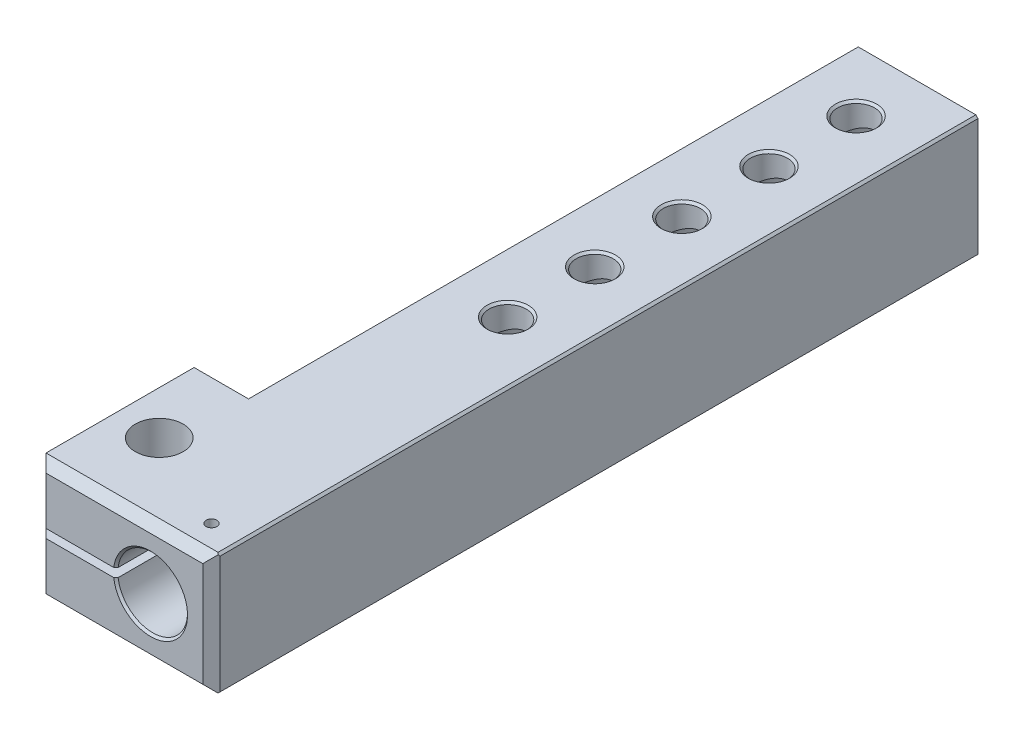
ISO-10303-21;
HEADER;
FILE_DESCRIPTION(('STEP AP214'),'2;1');
FILE_NAME('part.step','',(''),(''),'','','');
FILE_SCHEMA(('AUTOMOTIVE_DESIGN { 1 0 10303 214 1 1 1 1 }'));
ENDSEC;
DATA;
#1=APPLICATION_CONTEXT('core data for automotive mechanical design processes');
#2=APPLICATION_PROTOCOL_DEFINITION('international standard','automotive_design',2000,#1);
#3=PRODUCT_CONTEXT('',#1,'mechanical');
#4=PRODUCT('Part','Part','',(#3));
#5=PRODUCT_RELATED_PRODUCT_CATEGORY('part','',(#4));
#6=PRODUCT_DEFINITION_FORMATION('','',#4);
#7=PRODUCT_DEFINITION_CONTEXT('part definition',#1,'design');
#8=PRODUCT_DEFINITION('design','',#6,#7);
#9=PRODUCT_DEFINITION_SHAPE('','',#8);
#10=(LENGTH_UNIT() NAMED_UNIT(*) SI_UNIT(.MILLI.,.METRE.));
#11=(NAMED_UNIT(*) PLANE_ANGLE_UNIT() SI_UNIT($,.RADIAN.));
#12=(NAMED_UNIT(*) SI_UNIT($,.STERADIAN.) SOLID_ANGLE_UNIT());
#13=UNCERTAINTY_MEASURE_WITH_UNIT(LENGTH_MEASURE(1.E-05),#10,'distance_accuracy_value','');
#14=(GEOMETRIC_REPRESENTATION_CONTEXT(3) GLOBAL_UNCERTAINTY_ASSIGNED_CONTEXT((#13)) GLOBAL_UNIT_ASSIGNED_CONTEXT((#10,
#11,#12)) REPRESENTATION_CONTEXT('',''));
#15=CARTESIAN_POINT('',(0.,0.,0.));
#16=DIRECTION('',(0.,0.,1.));
#17=DIRECTION('',(1.,0.,0.));
#18=AXIS2_PLACEMENT_3D('',#15,#16,#17);
#19=CARTESIAN_POINT('',(7.,5.49999999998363,29.));
#20=DIRECTION('',(0.,1.,0.));
#21=DIRECTION('',(0.,0.,1.));
#22=AXIS2_PLACEMENT_3D('',#19,#20,#21);
#23=CONICAL_SURFACE('',#22,1.24999999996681,1.0297442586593);
#24=CARTESIAN_POINT('',(7.,4.74892422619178,29.));
#25=VERTEX_POINT('',#24);
#26=VERTEX_LOOP('',#25);
#27=FACE_BOUND('',#26,.T.);
#28=CARTESIAN_POINT('',(5.80947501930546,5.50000000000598,28.6190140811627));
#29=CARTESIAN_POINT('',(5.82497012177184,5.48363835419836,28.6599423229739));
#30=CARTESIAN_POINT('',(5.83903339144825,5.46863684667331,28.7024786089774));
#31=CARTESIAN_POINT('',(5.862486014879,5.44348684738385,28.7904488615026));
#32=CARTESIAN_POINT('',(5.87184400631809,5.43337093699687,28.8359000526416));
#33=CARTESIAN_POINT('',(5.88240865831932,5.42192941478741,28.917863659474));
#34=CARTESIAN_POINT('',(5.88501767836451,5.41909287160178,28.9539546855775));
#35=CARTESIAN_POINT('',(5.88581210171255,5.41822996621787,29.0260672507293));
#36=CARTESIAN_POINT('',(5.88401851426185,5.42018075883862,29.0620883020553));
#37=CARTESIAN_POINT('',(5.8754614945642,5.42945660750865,29.141722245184));
#38=CARTESIAN_POINT('',(5.8676033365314,5.43796481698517,29.1850698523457));
#39=CARTESIAN_POINT('',(5.84726856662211,5.45982285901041,29.2694384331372));
#40=CARTESIAN_POINT('',(5.83477401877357,5.47319149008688,29.3104496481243));
#41=CARTESIAN_POINT('',(5.81706514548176,5.4919744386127,29.36059138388));
#42=CARTESIAN_POINT('',(5.81331638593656,5.49594276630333,29.3708278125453));
#43=CARTESIAN_POINT('',(5.80947501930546,5.50000000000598,29.3809859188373));
#44=B_SPLINE_CURVE_WITH_KNOTS('',3,(#28,#29,#30,#31,#32,#33,#34,#35,#36,#37,#38,#39,#40,#41,#42,
#43),.UNSPECIFIED.,.F.,.F.,(4,2,2,2,2,2,2,4),(0.,0.140836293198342,0.282599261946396,
0.390911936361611,0.498708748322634,0.632515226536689,0.766844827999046,0.801639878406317),.UNSPECIFIED.);
#45=CARTESIAN_POINT('',(5.80947501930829,5.50000000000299,28.6190140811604));
#46=VERTEX_POINT('',#45);
#47=CARTESIAN_POINT('',(5.80947501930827,5.50000000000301,29.3809859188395));
#48=VERTEX_POINT('',#47);
#49=EDGE_CURVE('E20',#46,#48,#44,.T.);
#50=ORIENTED_EDGE('',*,*,#49,.T.);
#51=CARTESIAN_POINT('',(7.,5.5,29.));
#52=DIRECTION('',(0.,1.,0.));
#53=DIRECTION('',(0.,0.,1.));
#54=AXIS2_PLACEMENT_3D('',#51,#52,#53);
#55=CIRCLE('',#54,1.24999999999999);
#56=EDGE_CURVE('E183',#48,#46,#55,.T.);
#57=ORIENTED_EDGE('',*,*,#56,.T.);
#58=EDGE_LOOP('',(#50,#57));
#59=FACE_BOUND('',#58,.T.);
#60=ADVANCED_FACE('F16',(#27,#59),#23,.F.);
#61=CARTESIAN_POINT('',(0.,14.00005,-126.));
#62=DIRECTION('',(0.,-1.,0.));
#63=DIRECTION('',(0.,0.,-1.));
#64=AXIS2_PLACEMENT_3D('',#61,#62,#63);
#65=CYLINDRICAL_SURFACE('',#64,4.25);
#66=CARTESIAN_POINT('',(0.,9.,-121.75));
#67=CARTESIAN_POINT('',(-0.112594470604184,9.00000150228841,-121.749998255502));
#68=CARTESIAN_POINT('',(-0.22516836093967,8.99788307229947,-121.754477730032));
#69=CARTESIAN_POINT('',(-0.449485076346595,8.98946922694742,-121.772338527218));
#70=CARTESIAN_POINT('',(-0.561227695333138,8.98317280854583,-121.785721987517));
#71=CARTESIAN_POINT('',(-0.783095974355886,8.96655682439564,-121.82125746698));
#72=CARTESIAN_POINT('',(-0.893220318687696,8.95623415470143,-121.843416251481));
#73=CARTESIAN_POINT('',(-1.11099686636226,8.93183766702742,-121.896250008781));
#74=CARTESIAN_POINT('',(-1.2186480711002,8.91776236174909,-121.926928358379));
#75=CARTESIAN_POINT('',(-1.53598291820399,8.87052434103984,-122.031047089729));
#76=CARTESIAN_POINT('',(-1.74104210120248,8.8322703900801,-122.116733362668));
#77=CARTESIAN_POINT('',(-2.13355461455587,8.7457698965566,-122.317719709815));
#78=CARTESIAN_POINT('',(-2.32100639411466,8.69752247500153,-122.433022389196));
#79=CARTESIAN_POINT('',(-2.68480804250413,8.59241457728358,-122.697336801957));
#80=CARTESIAN_POINT('',(-2.85996165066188,8.53522441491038,-122.84786599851));
#81=CARTESIAN_POINT('',(-3.18359022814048,8.41987749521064,-123.175054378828));
#82=CARTESIAN_POINT('',(-3.33204853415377,8.36172015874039,-123.351729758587));
#83=CARTESIAN_POINT('',(-3.60812256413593,8.24653452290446,-123.740699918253));
#84=CARTESIAN_POINT('',(-3.73366706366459,8.18984476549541,-123.954590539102));
#85=CARTESIAN_POINT('',(-3.89321207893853,8.11457697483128,-124.290947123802));
#86=CARTESIAN_POINT('',(-3.94161056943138,8.09110890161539,-124.405696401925));
#87=CARTESIAN_POINT('',(-4.02833706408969,8.04828187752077,-124.639657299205));
#88=CARTESIAN_POINT('',(-4.0666707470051,8.02892061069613,-124.758866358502));
#89=CARTESIAN_POINT('',(-4.13093286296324,7.99603802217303,-124.994059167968));
#90=CARTESIAN_POINT('',(-4.15743641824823,7.98225008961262,-125.10984889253));
#91=CARTESIAN_POINT('',(-4.20069493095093,7.95957039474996,-125.343658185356));
#92=CARTESIAN_POINT('',(-4.21745480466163,7.95067616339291,-125.461676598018));
#93=CARTESIAN_POINT('',(-4.24099761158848,7.93814326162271,-125.698929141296));
#94=CARTESIAN_POINT('',(-4.24778512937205,7.93450217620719,-125.81816268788));
#95=CARTESIAN_POINT('',(-4.25129536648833,7.93262203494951,-126.056814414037));
#96=CARTESIAN_POINT('',(-4.24801887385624,7.9343825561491,-126.176232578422));
#97=CARTESIAN_POINT('',(-4.23231493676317,7.94276895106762,-126.401775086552));
#98=CARTESIAN_POINT('',(-4.22087578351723,7.94886917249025,-126.507989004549));
#99=CARTESIAN_POINT('',(-4.1901045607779,7.96513125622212,-126.718962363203));
#100=CARTESIAN_POINT('',(-4.17076997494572,7.97529441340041,-126.82372132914));
#101=CARTESIAN_POINT('',(-4.10121259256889,8.01142087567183,-127.134716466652));
#102=CARTESIAN_POINT('',(-4.03942411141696,8.04302818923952,-127.337838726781));
#103=CARTESIAN_POINT('',(-3.88561208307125,8.11846312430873,-127.735242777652));
#104=CARTESIAN_POINT('',(-3.79292101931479,8.16255697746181,-127.929210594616));
#105=CARTESIAN_POINT('',(-3.58040391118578,8.2579813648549,-128.299746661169));
#106=CARTESIAN_POINT('',(-3.46056664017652,8.30931488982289,-128.476307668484));
#107=CARTESIAN_POINT('',(-3.18159913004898,8.42035581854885,-128.827672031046));
#108=CARTESIAN_POINT('',(-3.01957906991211,8.48035908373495,-129.000089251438));
#109=CARTESIAN_POINT('',(-2.66837155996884,8.5973227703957,-129.31633517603));
#110=CARTESIAN_POINT('',(-2.47916793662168,8.65428135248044,-129.460146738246));
#111=CARTESIAN_POINT('',(-2.17440838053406,8.73404901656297,-129.653726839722));
#112=CARTESIAN_POINT('',(-2.06714429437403,8.76011704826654,-129.715481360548));
#113=CARTESIAN_POINT('',(-1.84708889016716,8.80913958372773,-129.829634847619));
#114=CARTESIAN_POINT('',(-1.73430002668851,8.83209545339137,-129.882037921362));
#115=CARTESIAN_POINT('',(-1.5041146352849,8.87419355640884,-129.976885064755));
#116=CARTESIAN_POINT('',(-1.38672490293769,8.89334117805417,-130.019343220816));
#117=CARTESIAN_POINT('',(-1.14813501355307,8.92727848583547,-130.093885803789));
#118=CARTESIAN_POINT('',(-1.02693639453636,8.94206990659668,-130.125974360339));
#119=CARTESIAN_POINT('',(-0.756387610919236,8.96938991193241,-130.18488724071));
#120=CARTESIAN_POINT('',(-0.606384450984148,8.98082349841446,-130.209262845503));
#121=CARTESIAN_POINT('',(-0.304241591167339,8.99612730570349,-130.241817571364));
#122=CARTESIAN_POINT('',(-0.152102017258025,8.99999797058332,-130.249997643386));
#123=CARTESIAN_POINT('',(0.112594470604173,9.00000150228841,-130.250001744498));
#124=CARTESIAN_POINT('',(0.225168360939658,8.99788307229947,-130.245522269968));
#125=CARTESIAN_POINT('',(0.449485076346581,8.98946922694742,-130.227661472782));
#126=CARTESIAN_POINT('',(0.561227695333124,8.98317280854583,-130.214278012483));
#127=CARTESIAN_POINT('',(0.783095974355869,8.96655682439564,-130.17874253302));
#128=CARTESIAN_POINT('',(0.893220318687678,8.95623415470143,-130.156583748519));
#129=CARTESIAN_POINT('',(1.11099686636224,8.93183766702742,-130.103749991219));
#130=CARTESIAN_POINT('',(1.21864807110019,8.9177623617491,-130.073071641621));
#131=CARTESIAN_POINT('',(1.53598291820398,8.87052434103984,-129.968952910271));
#132=CARTESIAN_POINT('',(1.74104210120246,8.8322703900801,-129.883266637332));
#133=CARTESIAN_POINT('',(2.13355461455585,8.74576989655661,-129.682280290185));
#134=CARTESIAN_POINT('',(2.32100639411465,8.69752247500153,-129.566977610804));
#135=CARTESIAN_POINT('',(2.68480804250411,8.59241457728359,-129.302663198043));
#136=CARTESIAN_POINT('',(2.85996165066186,8.53522441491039,-129.15213400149));
#137=CARTESIAN_POINT('',(3.18359022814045,8.41987749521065,-128.824945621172));
#138=CARTESIAN_POINT('',(3.33204853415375,8.3617201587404,-128.648270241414));
#139=CARTESIAN_POINT('',(3.60812256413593,8.24653452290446,-128.259300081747));
#140=CARTESIAN_POINT('',(3.73366706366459,8.18984476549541,-128.045409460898));
#141=CARTESIAN_POINT('',(3.89321207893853,8.11457697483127,-127.709052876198));
#142=CARTESIAN_POINT('',(3.94161056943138,8.09110890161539,-127.594303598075));
#143=CARTESIAN_POINT('',(4.02833706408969,8.04828187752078,-127.360342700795));
#144=CARTESIAN_POINT('',(4.06667074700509,8.02892061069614,-127.241133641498));
#145=CARTESIAN_POINT('',(4.13093286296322,7.99603802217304,-127.005940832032));
#146=CARTESIAN_POINT('',(4.15743641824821,7.98225008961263,-126.89015110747));
#147=CARTESIAN_POINT('',(4.20069493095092,7.95957039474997,-126.656341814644));
#148=CARTESIAN_POINT('',(4.21745480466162,7.95067616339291,-126.538323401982));
#149=CARTESIAN_POINT('',(4.24099761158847,7.93814326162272,-126.301070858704));
#150=CARTESIAN_POINT('',(4.24778512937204,7.9345021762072,-126.18183731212));
#151=CARTESIAN_POINT('',(4.25129536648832,7.93262203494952,-125.943185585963));
#152=CARTESIAN_POINT('',(4.24801887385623,7.9343825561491,-125.823767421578));
#153=CARTESIAN_POINT('',(4.23231493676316,7.94276895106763,-125.598224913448));
#154=CARTESIAN_POINT('',(4.22087578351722,7.94886917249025,-125.492010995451));
#155=CARTESIAN_POINT('',(4.19010456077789,7.96513125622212,-125.281037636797));
#156=CARTESIAN_POINT('',(4.17076997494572,7.97529441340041,-125.17627867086));
#157=CARTESIAN_POINT('',(4.10121259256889,8.01142087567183,-124.865283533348));
#158=CARTESIAN_POINT('',(4.03942411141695,8.04302818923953,-124.662161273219));
#159=CARTESIAN_POINT('',(3.88561208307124,8.11846312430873,-124.264757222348));
#160=CARTESIAN_POINT('',(3.79292101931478,8.16255697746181,-124.070789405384));
#161=CARTESIAN_POINT('',(3.58040391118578,8.2579813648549,-123.700253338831));
#162=CARTESIAN_POINT('',(3.46056664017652,8.30931488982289,-123.523692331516));
#163=CARTESIAN_POINT('',(3.18159913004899,8.42035581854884,-123.172327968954));
#164=CARTESIAN_POINT('',(3.01957906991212,8.48035908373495,-122.999910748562));
#165=CARTESIAN_POINT('',(2.66837155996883,8.5973227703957,-122.68366482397));
#166=CARTESIAN_POINT('',(2.47916793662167,8.65428135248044,-122.539853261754));
#167=CARTESIAN_POINT('',(2.17440838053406,8.73404901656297,-122.346273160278));
#168=CARTESIAN_POINT('',(2.06714429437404,8.76011704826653,-122.284518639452));
#169=CARTESIAN_POINT('',(1.84708889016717,8.80913958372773,-122.170365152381));
#170=CARTESIAN_POINT('',(1.73430002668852,8.83209545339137,-122.117962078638));
#171=CARTESIAN_POINT('',(1.5041146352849,8.87419355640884,-122.023114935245));
#172=CARTESIAN_POINT('',(1.38672490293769,8.89334117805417,-121.980656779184));
#173=CARTESIAN_POINT('',(1.14813501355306,8.92727848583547,-121.906114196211));
#174=CARTESIAN_POINT('',(1.02693639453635,8.94206990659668,-121.874025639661));
#175=CARTESIAN_POINT('',(0.756387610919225,8.96938991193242,-121.81511275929));
#176=CARTESIAN_POINT('',(0.606384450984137,8.98082349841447,-121.790737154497));
#177=CARTESIAN_POINT('',(0.304241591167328,8.99612730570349,-121.758182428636));
#178=CARTESIAN_POINT('',(0.152102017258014,8.99999797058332,-121.750002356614));
#179=CARTESIAN_POINT('',(0.,9.,-121.75));
#180=B_SPLINE_CURVE_WITH_KNOTS('',3,(#66,#67,#68,#69,#70,#71,#72,#73,#74,#75,#76,#77,#78,#79,
#80,#81,#82,#83,#84,#85,#86,#87,#88,#89,#90,#91,#92,#93,#94,#95,#96,#97,#98,#99,#100,#101,#102,
#103,#104,#105,#106,#107,#108,#109,#110,#111,#112,#113,#114,#115,#116,#117,#118,#119,#120,#121,
#122,#123,#124,#125,#126,#127,#128,#129,#130,#131,#132,#133,#134,#135,#136,#137,#138,#139,#140,
#141,#142,#143,#144,#145,#146,#147,#148,#149,#150,#151,#152,#153,#154,#155,#156,#157,#158,#159,
#160,#161,#162,#163,#164,#165,#166,#167,#168,#169,#170,#171,#172,#173,#174,#175,#176,#177,#178,
#179),.UNSPECIFIED.,.T.,.F.,(4,2,2,2,2,2,2,2,2,2,2,2,2,2,2,2,2,2,2,2,2,2,2,2,2,2,2,2,2,2,2,2,2,
2,2,2,2,2,2,2,2,2,2,2,2,2,2,2,2,2,2,2,2,2,2,2,4),(0.,0.337638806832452,0.675358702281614,
1.01333947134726,1.35145439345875,2.0246910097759,2.69798686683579,3.40870771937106,
4.11987067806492,4.87882708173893,5.25857590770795,5.63811000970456,5.99636012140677,
6.35442931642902,6.71233384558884,7.07021035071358,7.39082570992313,7.71154333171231,
8.35247956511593,9.00826959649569,9.66433133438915,10.3934658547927,11.123036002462,
11.5020734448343,11.8809439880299,12.2592745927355,12.6374543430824,13.0935918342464,
13.5497025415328,13.8873413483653,14.2250612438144,14.5630420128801,14.9011569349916,
15.5743935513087,16.2476894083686,16.9584102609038,17.6695732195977,18.4285296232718,
18.8082784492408,19.1878125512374,19.5460626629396,19.9041318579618,20.2620363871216,
20.6199128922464,20.9405282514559,21.2612458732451,21.9021821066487,22.5579721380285,
23.2140338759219,23.9431683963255,24.6727385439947,25.0517759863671,25.4306465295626,
25.8089771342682,26.1871568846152,26.6432943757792,27.0994050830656),.UNSPECIFIED.);
#181=CARTESIAN_POINT('',(0.,9.,-121.75));
#182=VERTEX_POINT('',#181);
#183=EDGE_CURVE('E261',#182,#182,#180,.T.);
#184=ORIENTED_EDGE('',*,*,#183,.T.);
#185=EDGE_LOOP('',(#184));
#186=FACE_BOUND('',#185,.T.);
#187=CARTESIAN_POINT('',(0.,13.499999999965,-126.));
#188=DIRECTION('',(0.,1.,0.));
#189=DIRECTION('',(0.,0.,1.));
#190=AXIS2_PLACEMENT_3D('',#187,#188,#189);
#191=CIRCLE('',#190,4.25000000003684);
#192=CARTESIAN_POINT('',(0.,13.499999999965,-121.749999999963));
#193=VERTEX_POINT('',#192);
#194=EDGE_CURVE('E191',#193,#193,#191,.T.);
#195=ORIENTED_EDGE('',*,*,#194,.T.);
#196=EDGE_LOOP('',(#195));
#197=FACE_BOUND('',#196,.T.);
#198=ADVANCED_FACE('F284',(#186,#197),#65,.F.);
#199=CARTESIAN_POINT('',(0.,14.00005,-86.));
#200=DIRECTION('',(0.,-1.,0.));
#201=DIRECTION('',(0.,0.,-1.));
#202=AXIS2_PLACEMENT_3D('',#199,#200,#201);
#203=CYLINDRICAL_SURFACE('',#202,4.25);
#204=CARTESIAN_POINT('',(0.,9.,-81.75));
#205=CARTESIAN_POINT('',(-0.112594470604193,9.00000150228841,-81.749998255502));
#206=CARTESIAN_POINT('',(-0.225168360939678,8.99788307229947,-81.7544777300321));
#207=CARTESIAN_POINT('',(-0.449485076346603,8.98946922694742,-81.7723385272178));
#208=CARTESIAN_POINT('',(-0.561227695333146,8.98317280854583,-81.7857219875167));
#209=CARTESIAN_POINT('',(-0.783095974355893,8.96655682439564,-81.8212574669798));
#210=CARTESIAN_POINT('',(-0.893220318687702,8.95623415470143,-81.8434162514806));
#211=CARTESIAN_POINT('',(-1.11099686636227,8.93183766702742,-81.8962500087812));
#212=CARTESIAN_POINT('',(-1.21864807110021,8.91776236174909,-81.9269283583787));
#213=CARTESIAN_POINT('',(-1.535982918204,8.87052434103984,-82.0310470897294));
#214=CARTESIAN_POINT('',(-1.7410421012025,8.8322703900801,-82.1167333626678));
#215=CARTESIAN_POINT('',(-2.13355461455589,8.7457698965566,-82.3177197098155));
#216=CARTESIAN_POINT('',(-2.32100639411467,8.69752247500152,-82.4330223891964));
#217=CARTESIAN_POINT('',(-2.68480804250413,8.59241457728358,-82.6973368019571));
#218=CARTESIAN_POINT('',(-2.85996165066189,8.53522441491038,-82.8478659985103));
#219=CARTESIAN_POINT('',(-3.18359022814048,8.41987749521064,-83.175054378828));
#220=CARTESIAN_POINT('',(-3.33204853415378,8.36172015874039,-83.3517297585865));
#221=CARTESIAN_POINT('',(-3.60812256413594,8.24653452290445,-83.7406999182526));
#222=CARTESIAN_POINT('',(-3.73366706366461,8.1898447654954,-83.9545905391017));
#223=CARTESIAN_POINT('',(-3.89321207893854,8.11457697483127,-84.2909471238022));
#224=CARTESIAN_POINT('',(-3.9416105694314,8.09110890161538,-84.4056964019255));
#225=CARTESIAN_POINT('',(-4.0283370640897,8.04828187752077,-84.639657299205));
#226=CARTESIAN_POINT('',(-4.06667074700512,8.02892061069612,-84.7588663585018));
#227=CARTESIAN_POINT('',(-4.13093286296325,7.99603802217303,-84.9940591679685));
#228=CARTESIAN_POINT('',(-4.15743641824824,7.98225008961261,-85.10984889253));
#229=CARTESIAN_POINT('',(-4.20069493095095,7.95957039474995,-85.343658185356));
#230=CARTESIAN_POINT('',(-4.21745480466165,7.9506761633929,-85.4616765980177));
#231=CARTESIAN_POINT('',(-4.24099761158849,7.9381432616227,-85.6989291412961));
#232=CARTESIAN_POINT('',(-4.24778512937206,7.93450217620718,-85.8181626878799));
#233=CARTESIAN_POINT('',(-4.25129536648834,7.93262203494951,-86.056814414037));
#234=CARTESIAN_POINT('',(-4.24801887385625,7.93438255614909,-86.1762325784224));
#235=CARTESIAN_POINT('',(-4.23231493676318,7.94276895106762,-86.4017750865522));
#236=CARTESIAN_POINT('',(-4.22087578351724,7.94886917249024,-86.5079890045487));
#237=CARTESIAN_POINT('',(-4.19010456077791,7.96513125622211,-86.7189623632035));
#238=CARTESIAN_POINT('',(-4.17076997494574,7.9752944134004,-86.8237213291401));
#239=CARTESIAN_POINT('',(-4.10121259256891,8.01142087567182,-87.1347164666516));
#240=CARTESIAN_POINT('',(-4.03942411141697,8.04302818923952,-87.3378387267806));
#241=CARTESIAN_POINT('',(-3.88561208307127,8.11846312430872,-87.735242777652));
#242=CARTESIAN_POINT('',(-3.7929210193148,8.1625569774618,-87.9292105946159));
#243=CARTESIAN_POINT('',(-3.5804039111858,8.25798136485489,-88.2997466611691));
#244=CARTESIAN_POINT('',(-3.46056664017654,8.30931488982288,-88.4763076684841));
#245=CARTESIAN_POINT('',(-3.18159913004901,8.42035581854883,-88.8276720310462));
#246=CARTESIAN_POINT('',(-3.01957906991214,8.48035908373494,-89.0000892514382));
#247=CARTESIAN_POINT('',(-2.66837155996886,8.59732277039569,-89.3163351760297));
#248=CARTESIAN_POINT('',(-2.47916793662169,8.65428135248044,-89.4601467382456));
#249=CARTESIAN_POINT('',(-2.17440838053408,8.73404901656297,-89.6537268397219));
#250=CARTESIAN_POINT('',(-2.06714429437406,8.76011704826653,-89.7154813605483));
#251=CARTESIAN_POINT('',(-1.84708889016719,8.80913958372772,-89.8296348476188));
#252=CARTESIAN_POINT('',(-1.73430002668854,8.83209545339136,-89.8820379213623));
#253=CARTESIAN_POINT('',(-1.50411463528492,8.87419355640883,-89.9768850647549));
#254=CARTESIAN_POINT('',(-1.38672490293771,8.89334117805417,-90.0193432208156));
#255=CARTESIAN_POINT('',(-1.14813501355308,8.92727848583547,-90.0938858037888));
#256=CARTESIAN_POINT('',(-1.02693639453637,8.94206990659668,-90.1259743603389));
#257=CARTESIAN_POINT('',(-0.756387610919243,8.96938991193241,-90.1848872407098));
#258=CARTESIAN_POINT('',(-0.606384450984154,8.98082349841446,-90.2092628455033));
#259=CARTESIAN_POINT('',(-0.304241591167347,8.99612730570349,-90.241817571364));
#260=CARTESIAN_POINT('',(-0.152102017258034,8.99999797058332,-90.2499976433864));
#261=CARTESIAN_POINT('',(0.112594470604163,9.00000150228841,-90.250001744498));
#262=CARTESIAN_POINT('',(0.225168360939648,8.99788307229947,-90.2455222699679));
#263=CARTESIAN_POINT('',(0.449485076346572,8.98946922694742,-90.2276614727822));
#264=CARTESIAN_POINT('',(0.561227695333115,8.98317280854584,-90.2142780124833));
#265=CARTESIAN_POINT('',(0.783095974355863,8.96655682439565,-90.1787425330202));
#266=CARTESIAN_POINT('',(0.893220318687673,8.95623415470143,-90.1565837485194));
#267=CARTESIAN_POINT('',(1.11099686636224,8.93183766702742,-90.1037499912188));
#268=CARTESIAN_POINT('',(1.21864807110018,8.9177623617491,-90.0730716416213));
#269=CARTESIAN_POINT('',(1.53598291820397,8.87052434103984,-89.9689529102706));
#270=CARTESIAN_POINT('',(1.74104210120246,8.8322703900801,-89.8832666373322));
#271=CARTESIAN_POINT('',(2.13355461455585,8.74576989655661,-89.6822802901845));
#272=CARTESIAN_POINT('',(2.32100639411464,8.69752247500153,-89.5669776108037));
#273=CARTESIAN_POINT('',(2.6848080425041,8.59241457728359,-89.3026631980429));
#274=CARTESIAN_POINT('',(2.85996165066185,8.53522441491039,-89.1521340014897));
#275=CARTESIAN_POINT('',(3.18359022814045,8.41987749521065,-88.824945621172));
#276=CARTESIAN_POINT('',(3.33204853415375,8.3617201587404,-88.6482702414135));
#277=CARTESIAN_POINT('',(3.60812256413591,8.24653452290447,-88.2593000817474));
#278=CARTESIAN_POINT('',(3.73366706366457,8.18984476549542,-88.0454094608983));
#279=CARTESIAN_POINT('',(3.89321207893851,8.11457697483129,-87.7090528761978));
#280=CARTESIAN_POINT('',(3.94161056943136,8.09110890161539,-87.5943035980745));
#281=CARTESIAN_POINT('',(4.02833706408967,8.04828187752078,-87.360342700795));
#282=CARTESIAN_POINT('',(4.06667074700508,8.02892061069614,-87.2411336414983));
#283=CARTESIAN_POINT('',(4.13093286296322,7.99603802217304,-87.0059408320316));
#284=CARTESIAN_POINT('',(4.15743641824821,7.98225008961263,-86.89015110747));
#285=CARTESIAN_POINT('',(4.20069493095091,7.95957039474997,-86.656341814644));
#286=CARTESIAN_POINT('',(4.21745480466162,7.95067616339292,-86.5383234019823));
#287=CARTESIAN_POINT('',(4.24099761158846,7.93814326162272,-86.3010708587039));
#288=CARTESIAN_POINT('',(4.24778512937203,7.9345021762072,-86.1818373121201));
#289=CARTESIAN_POINT('',(4.25129536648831,7.93262203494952,-85.9431855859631));
#290=CARTESIAN_POINT('',(4.24801887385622,7.93438255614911,-85.8237674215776));
#291=CARTESIAN_POINT('',(4.23231493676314,7.94276895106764,-85.5982249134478));
#292=CARTESIAN_POINT('',(4.22087578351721,7.94886917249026,-85.4920109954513));
#293=CARTESIAN_POINT('',(4.19010456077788,7.96513125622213,-85.2810376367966));
#294=CARTESIAN_POINT('',(4.17076997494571,7.97529441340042,-85.1762786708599));
#295=CARTESIAN_POINT('',(4.10121259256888,8.01142087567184,-84.8652835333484));
#296=CARTESIAN_POINT('',(4.03942411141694,8.04302818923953,-84.6621612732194));
#297=CARTESIAN_POINT('',(3.88561208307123,8.11846312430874,-84.264757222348));
#298=CARTESIAN_POINT('',(3.79292101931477,8.16255697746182,-84.0707894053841));
#299=CARTESIAN_POINT('',(3.58040391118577,8.2579813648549,-83.7002533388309));
#300=CARTESIAN_POINT('',(3.46056664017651,8.30931488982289,-83.5236923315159));
#301=CARTESIAN_POINT('',(3.18159913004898,8.42035581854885,-83.1723279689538));
#302=CARTESIAN_POINT('',(3.01957906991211,8.48035908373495,-82.9999107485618));
#303=CARTESIAN_POINT('',(2.66837155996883,8.5973227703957,-82.6836648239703));
#304=CARTESIAN_POINT('',(2.47916793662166,8.65428135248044,-82.5398532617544));
#305=CARTESIAN_POINT('',(2.17440838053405,8.73404901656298,-82.3462731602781));
#306=CARTESIAN_POINT('',(2.06714429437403,8.76011704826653,-82.2845186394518));
#307=CARTESIAN_POINT('',(1.84708889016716,8.80913958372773,-82.1703651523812));
#308=CARTESIAN_POINT('',(1.7343000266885,8.83209545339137,-82.1179620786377));
#309=CARTESIAN_POINT('',(1.50411463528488,8.87419355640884,-82.0231149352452));
#310=CARTESIAN_POINT('',(1.38672490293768,8.89334117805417,-81.9806567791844));
#311=CARTESIAN_POINT('',(1.14813501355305,8.92727848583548,-81.9061141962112));
#312=CARTESIAN_POINT('',(1.02693639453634,8.94206990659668,-81.8740256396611));
#313=CARTESIAN_POINT('',(0.756387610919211,8.96938991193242,-81.8151127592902));
#314=CARTESIAN_POINT('',(0.606384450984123,8.98082349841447,-81.7907371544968));
#315=CARTESIAN_POINT('',(0.304241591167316,8.99612730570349,-81.758182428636));
#316=CARTESIAN_POINT('',(0.152102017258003,8.99999797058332,-81.7500023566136));
#317=CARTESIAN_POINT('',(0.,9.,-81.75));
#318=B_SPLINE_CURVE_WITH_KNOTS('',3,(#204,#205,#206,#207,#208,#209,#210,#211,#212,#213,#214,
#215,#216,#217,#218,#219,#220,#221,#222,#223,#224,#225,#226,#227,#228,#229,#230,#231,#232,#233,
#234,#235,#236,#237,#238,#239,#240,#241,#242,#243,#244,#245,#246,#247,#248,#249,#250,#251,#252,
#253,#254,#255,#256,#257,#258,#259,#260,#261,#262,#263,#264,#265,#266,#267,#268,#269,#270,#271,
#272,#273,#274,#275,#276,#277,#278,#279,#280,#281,#282,#283,#284,#285,#286,#287,#288,#289,#290,
#291,#292,#293,#294,#295,#296,#297,#298,#299,#300,#301,#302,#303,#304,#305,#306,#307,#308,#309,
#310,#311,#312,#313,#314,#315,#316,#317),.UNSPECIFIED.,.T.,.F.,(4,2,2,2,2,2,2,2,2,2,2,2,2,2,2,2,
2,2,2,2,2,2,2,2,2,2,2,2,2,2,2,2,2,2,2,2,2,2,2,2,2,2,2,2,2,2,2,2,2,2,2,2,2,2,2,2,4),(0.,
0.337638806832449,0.675358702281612,1.01333947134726,1.35145439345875,2.0246910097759,
2.69798686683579,3.40870771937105,4.11987067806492,4.87882708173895,5.25857590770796,
5.63811000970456,5.99636012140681,6.35442931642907,6.71233384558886,7.07021035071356,
7.39082570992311,7.71154333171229,8.35247956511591,9.00826959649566,9.66433133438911,
10.3934658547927,11.1230360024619,11.5020734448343,11.8809439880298,12.2592745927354,
12.6374543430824,13.0935918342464,13.5497025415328,13.8873413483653,14.2250612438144,
14.5630420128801,14.9011569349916,15.5743935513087,16.2476894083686,16.9584102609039,
17.6695732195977,18.4285296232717,18.8082784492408,19.1878125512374,19.5460626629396,
19.9041318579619,20.2620363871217,20.6199128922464,20.9405282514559,21.2612458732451,
21.9021821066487,22.5579721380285,23.2140338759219,23.9431683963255,24.6727385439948,
25.0517759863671,25.4306465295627,25.8089771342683,26.1871568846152,26.6432943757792,
27.0994050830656),.UNSPECIFIED.);
#319=CARTESIAN_POINT('',(0.,9.,-81.75));
#320=VERTEX_POINT('',#319);
#321=EDGE_CURVE('E273',#320,#320,#318,.T.);
#322=ORIENTED_EDGE('',*,*,#321,.T.);
#323=EDGE_LOOP('',(#322));
#324=FACE_BOUND('',#323,.T.);
#325=CARTESIAN_POINT('',(0.,13.499999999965,-86.));
#326=DIRECTION('',(0.,1.,0.));
#327=DIRECTION('',(0.,0.,1.));
#328=AXIS2_PLACEMENT_3D('',#325,#326,#327);
#329=CIRCLE('',#328,4.25000000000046);
#330=CARTESIAN_POINT('',(0.,13.499999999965,-81.7499999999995));
#331=VERTEX_POINT('',#330);
#332=EDGE_CURVE('E561',#331,#331,#329,.T.);
#333=ORIENTED_EDGE('',*,*,#332,.T.);
#334=EDGE_LOOP('',(#333));
#335=FACE_BOUND('',#334,.T.);
#336=ADVANCED_FACE('F280',(#324,#335),#203,.F.);
#337=CARTESIAN_POINT('',(0.,14.00005,-46.));
#338=DIRECTION('',(0.,-1.,0.));
#339=DIRECTION('',(0.,0.,-1.));
#340=AXIS2_PLACEMENT_3D('',#337,#338,#339);
#341=CYLINDRICAL_SURFACE('',#340,4.25);
#342=CARTESIAN_POINT('',(0.,9.,-41.75));
#343=CARTESIAN_POINT('',(-0.112594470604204,9.00000150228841,-41.749998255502));
#344=CARTESIAN_POINT('',(-0.22516836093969,8.99788307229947,-41.7544777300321));
#345=CARTESIAN_POINT('',(-0.449485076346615,8.98946922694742,-41.7723385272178));
#346=CARTESIAN_POINT('',(-0.561227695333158,8.98317280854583,-41.7857219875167));
#347=CARTESIAN_POINT('',(-0.783095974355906,8.96655682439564,-41.8212574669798));
#348=CARTESIAN_POINT('',(-0.893220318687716,8.95623415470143,-41.8434162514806));
#349=CARTESIAN_POINT('',(-1.11099686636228,8.93183766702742,-41.8962500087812));
#350=CARTESIAN_POINT('',(-1.21864807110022,8.91776236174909,-41.9269283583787));
#351=CARTESIAN_POINT('',(-1.53598291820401,8.87052434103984,-42.0310470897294));
#352=CARTESIAN_POINT('',(-1.7410421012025,8.8322703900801,-42.1167333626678));
#353=CARTESIAN_POINT('',(-2.13355461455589,8.74576989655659,-42.3177197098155));
#354=CARTESIAN_POINT('',(-2.32100639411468,8.69752247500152,-42.4330223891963));
#355=CARTESIAN_POINT('',(-2.68480804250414,8.59241457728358,-42.6973368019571));
#356=CARTESIAN_POINT('',(-2.8599616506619,8.53522441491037,-42.8478659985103));
#357=CARTESIAN_POINT('',(-3.18359022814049,8.41987749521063,-43.175054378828));
#358=CARTESIAN_POINT('',(-3.33204853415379,8.36172015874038,-43.3517297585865));
#359=CARTESIAN_POINT('',(-3.60812256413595,8.24653452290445,-43.7406999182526));
#360=CARTESIAN_POINT('',(-3.73366706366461,8.1898447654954,-43.9545905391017));
#361=CARTESIAN_POINT('',(-3.89321207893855,8.11457697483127,-44.2909471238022));
#362=CARTESIAN_POINT('',(-3.9416105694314,8.09110890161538,-44.4056964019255));
#363=CARTESIAN_POINT('',(-4.02833706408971,8.04828187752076,-44.639657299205));
#364=CARTESIAN_POINT('',(-4.06667074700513,8.02892061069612,-44.7588663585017));
#365=CARTESIAN_POINT('',(-4.13093286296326,7.99603802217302,-44.9940591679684));
#366=CARTESIAN_POINT('',(-4.15743641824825,7.98225008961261,-45.10984889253));
#367=CARTESIAN_POINT('',(-4.20069493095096,7.95957039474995,-45.343658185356));
#368=CARTESIAN_POINT('',(-4.21745480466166,7.95067616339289,-45.4616765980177));
#369=CARTESIAN_POINT('',(-4.2409976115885,7.9381432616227,-45.6989291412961));
#370=CARTESIAN_POINT('',(-4.24778512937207,7.93450217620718,-45.8181626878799));
#371=CARTESIAN_POINT('',(-4.25129536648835,7.9326220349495,-46.056814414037));
#372=CARTESIAN_POINT('',(-4.24801887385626,7.93438255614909,-46.1762325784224));
#373=CARTESIAN_POINT('',(-4.23231493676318,7.94276895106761,-46.4017750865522));
#374=CARTESIAN_POINT('',(-4.22087578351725,7.94886917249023,-46.5079890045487));
#375=CARTESIAN_POINT('',(-4.19010456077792,7.96513125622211,-46.7189623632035));
#376=CARTESIAN_POINT('',(-4.17076997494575,7.97529441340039,-46.8237213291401));
#377=CARTESIAN_POINT('',(-4.10121259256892,8.01142087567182,-47.1347164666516));
#378=CARTESIAN_POINT('',(-4.03942411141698,8.04302818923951,-47.3378387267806));
#379=CARTESIAN_POINT('',(-3.88561208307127,8.11846312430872,-47.735242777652));
#380=CARTESIAN_POINT('',(-3.79292101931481,8.1625569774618,-47.9292105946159));
#381=CARTESIAN_POINT('',(-3.58040391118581,8.25798136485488,-48.2997466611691));
#382=CARTESIAN_POINT('',(-3.46056664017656,8.30931488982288,-48.4763076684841));
#383=CARTESIAN_POINT('',(-3.18159913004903,8.42035581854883,-48.8276720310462));
#384=CARTESIAN_POINT('',(-3.01957906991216,8.48035908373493,-49.0000892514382));
#385=CARTESIAN_POINT('',(-2.66837155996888,8.59732277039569,-49.3163351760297));
#386=CARTESIAN_POINT('',(-2.47916793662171,8.65428135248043,-49.4601467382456));
#387=CARTESIAN_POINT('',(-2.1744083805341,8.73404901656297,-49.6537268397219));
#388=CARTESIAN_POINT('',(-2.06714429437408,8.76011704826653,-49.7154813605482));
#389=CARTESIAN_POINT('',(-1.8470888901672,8.80913958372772,-49.8296348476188));
#390=CARTESIAN_POINT('',(-1.73430002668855,8.83209545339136,-49.8820379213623));
#391=CARTESIAN_POINT('',(-1.50411463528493,8.87419355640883,-49.9768850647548));
#392=CARTESIAN_POINT('',(-1.38672490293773,8.89334117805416,-50.0193432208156));
#393=CARTESIAN_POINT('',(-1.14813501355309,8.92727848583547,-50.0938858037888));
#394=CARTESIAN_POINT('',(-1.02693639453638,8.94206990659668,-50.1259743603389));
#395=CARTESIAN_POINT('',(-0.756387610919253,8.96938991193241,-50.1848872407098));
#396=CARTESIAN_POINT('',(-0.606384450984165,8.98082349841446,-50.2092628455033));
#397=CARTESIAN_POINT('',(-0.304241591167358,8.99612730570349,-50.241817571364));
#398=CARTESIAN_POINT('',(-0.152102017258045,8.99999797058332,-50.2499976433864));
#399=CARTESIAN_POINT('',(0.112594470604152,9.00000150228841,-50.250001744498));
#400=CARTESIAN_POINT('',(0.225168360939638,8.99788307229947,-50.2455222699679));
#401=CARTESIAN_POINT('',(0.449485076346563,8.98946922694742,-50.2276614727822));
#402=CARTESIAN_POINT('',(0.561227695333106,8.98317280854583,-50.2142780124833));
#403=CARTESIAN_POINT('',(0.783095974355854,8.96655682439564,-50.1787425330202));
#404=CARTESIAN_POINT('',(0.893220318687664,8.95623415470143,-50.1565837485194));
#405=CARTESIAN_POINT('',(1.11099686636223,8.93183766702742,-50.1037499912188));
#406=CARTESIAN_POINT('',(1.21864807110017,8.9177623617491,-50.0730716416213));
#407=CARTESIAN_POINT('',(1.53598291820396,8.87052434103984,-49.9689529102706));
#408=CARTESIAN_POINT('',(1.74104210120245,8.83227039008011,-49.8832666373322));
#409=CARTESIAN_POINT('',(2.13355461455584,8.74576989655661,-49.6822802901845));
#410=CARTESIAN_POINT('',(2.32100639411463,8.69752247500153,-49.5669776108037));
#411=CARTESIAN_POINT('',(2.68480804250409,8.59241457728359,-49.3026631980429));
#412=CARTESIAN_POINT('',(2.85996165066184,8.53522441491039,-49.1521340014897));
#413=CARTESIAN_POINT('',(3.18359022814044,8.41987749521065,-48.824945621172));
#414=CARTESIAN_POINT('',(3.33204853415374,8.36172015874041,-48.6482702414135));
#415=CARTESIAN_POINT('',(3.6081225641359,8.24653452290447,-48.2593000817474));
#416=CARTESIAN_POINT('',(3.73366706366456,8.18984476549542,-48.0454094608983));
#417=CARTESIAN_POINT('',(3.8932120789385,8.11457697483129,-47.7090528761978));
#418=CARTESIAN_POINT('',(3.94161056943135,8.0911089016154,-47.5943035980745));
#419=CARTESIAN_POINT('',(4.02833706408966,8.04828187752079,-47.360342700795));
#420=CARTESIAN_POINT('',(4.06667074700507,8.02892061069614,-47.2411336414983));
#421=CARTESIAN_POINT('',(4.13093286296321,7.99603802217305,-47.0059408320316));
#422=CARTESIAN_POINT('',(4.1574364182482,7.98225008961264,-46.89015110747));
#423=CARTESIAN_POINT('',(4.2006949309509,7.95957039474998,-46.656341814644));
#424=CARTESIAN_POINT('',(4.2174548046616,7.95067616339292,-46.5383234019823));
#425=CARTESIAN_POINT('',(4.24099761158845,7.93814326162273,-46.3010708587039));
#426=CARTESIAN_POINT('',(4.24778512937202,7.9345021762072,-46.1818373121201));
#427=CARTESIAN_POINT('',(4.2512953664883,7.93262203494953,-45.9431855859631));
#428=CARTESIAN_POINT('',(4.24801887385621,7.93438255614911,-45.8237674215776));
#429=CARTESIAN_POINT('',(4.23231493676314,7.94276895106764,-45.5982249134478));
#430=CARTESIAN_POINT('',(4.2208757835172,7.94886917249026,-45.4920109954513));
#431=CARTESIAN_POINT('',(4.19010456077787,7.96513125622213,-45.2810376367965));
#432=CARTESIAN_POINT('',(4.1707699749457,7.97529441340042,-45.1762786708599));
#433=CARTESIAN_POINT('',(4.10121259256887,8.01142087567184,-44.8652835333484));
#434=CARTESIAN_POINT('',(4.03942411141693,8.04302818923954,-44.6621612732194));
#435=CARTESIAN_POINT('',(3.88561208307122,8.11846312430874,-44.264757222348));
#436=CARTESIAN_POINT('',(3.79292101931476,8.16255697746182,-44.0707894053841));
#437=CARTESIAN_POINT('',(3.58040391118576,8.25798136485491,-43.7002533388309));
#438=CARTESIAN_POINT('',(3.46056664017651,8.3093148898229,-43.5236923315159));
#439=CARTESIAN_POINT('',(3.18159913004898,8.42035581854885,-43.1723279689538));
#440=CARTESIAN_POINT('',(3.01957906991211,8.48035908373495,-42.9999107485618));
#441=CARTESIAN_POINT('',(2.66837155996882,8.5973227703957,-42.6836648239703));
#442=CARTESIAN_POINT('',(2.47916793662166,8.65428135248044,-42.5398532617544));
#443=CARTESIAN_POINT('',(2.17440838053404,8.73404901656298,-42.3462731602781));
#444=CARTESIAN_POINT('',(2.06714429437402,8.76011704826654,-42.2845186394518));
#445=CARTESIAN_POINT('',(1.84708889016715,8.80913958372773,-42.1703651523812));
#446=CARTESIAN_POINT('',(1.7343000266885,8.83209545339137,-42.1179620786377));
#447=CARTESIAN_POINT('',(1.50411463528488,8.87419355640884,-42.0231149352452));
#448=CARTESIAN_POINT('',(1.38672490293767,8.89334117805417,-41.9806567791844));
#449=CARTESIAN_POINT('',(1.14813501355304,8.92727848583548,-41.9061141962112));
#450=CARTESIAN_POINT('',(1.02693639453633,8.94206990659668,-41.8740256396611));
#451=CARTESIAN_POINT('',(0.756387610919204,8.96938991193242,-41.8151127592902));
#452=CARTESIAN_POINT('',(0.606384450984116,8.98082349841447,-41.7907371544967));
#453=CARTESIAN_POINT('',(0.304241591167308,8.99612730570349,-41.758182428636));
#454=CARTESIAN_POINT('',(0.152102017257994,8.99999797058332,-41.7500023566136));
#455=CARTESIAN_POINT('',(0.,9.,-41.75));
#456=B_SPLINE_CURVE_WITH_KNOTS('',3,(#342,#343,#344,#345,#346,#347,#348,#349,#350,#351,#352,
#353,#354,#355,#356,#357,#358,#359,#360,#361,#362,#363,#364,#365,#366,#367,#368,#369,#370,#371,
#372,#373,#374,#375,#376,#377,#378,#379,#380,#381,#382,#383,#384,#385,#386,#387,#388,#389,#390,
#391,#392,#393,#394,#395,#396,#397,#398,#399,#400,#401,#402,#403,#404,#405,#406,#407,#408,#409,
#410,#411,#412,#413,#414,#415,#416,#417,#418,#419,#420,#421,#422,#423,#424,#425,#426,#427,#428,
#429,#430,#431,#432,#433,#434,#435,#436,#437,#438,#439,#440,#441,#442,#443,#444,#445,#446,#447,
#448,#449,#450,#451,#452,#453,#454,#455),.UNSPECIFIED.,.T.,.F.,(4,2,2,2,2,2,2,2,2,2,2,2,2,2,2,2,
2,2,2,2,2,2,2,2,2,2,2,2,2,2,2,2,2,2,2,2,2,2,2,2,2,2,2,2,2,2,2,2,2,2,2,2,2,2,2,2,4),(0.,
0.337638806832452,0.675358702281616,1.01333947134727,1.35145439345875,2.0246910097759,
2.69798686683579,3.40870771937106,4.11987067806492,4.87882708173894,5.25857590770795,
5.63811000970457,5.99636012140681,6.35442931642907,6.71233384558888,7.07021035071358,
7.39082570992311,7.71154333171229,8.35247956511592,9.00826959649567,9.66433133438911,
10.3934658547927,11.1230360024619,11.5020734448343,11.8809439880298,12.2592745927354,
12.6374543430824,13.0935918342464,13.5497025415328,13.8873413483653,14.2250612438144,
14.5630420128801,14.9011569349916,15.5743935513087,16.2476894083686,16.9584102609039,
17.6695732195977,18.4285296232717,18.8082784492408,19.1878125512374,19.5460626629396,
19.9041318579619,20.2620363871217,20.6199128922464,20.9405282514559,21.2612458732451,
21.9021821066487,22.5579721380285,23.2140338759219,23.9431683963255,24.6727385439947,
25.0517759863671,25.4306465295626,25.8089771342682,26.1871568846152,26.6432943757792,
27.0994050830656),.UNSPECIFIED.);
#457=CARTESIAN_POINT('',(0.,9.,-41.75));
#458=VERTEX_POINT('',#457);
#459=EDGE_CURVE('E269',#458,#458,#456,.T.);
#460=ORIENTED_EDGE('',*,*,#459,.T.);
#461=EDGE_LOOP('',(#460));
#462=FACE_BOUND('',#461,.T.);
#463=CARTESIAN_POINT('',(0.,13.499999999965,-46.));
#464=DIRECTION('',(0.,1.,0.));
#465=DIRECTION('',(0.,0.,1.));
#466=AXIS2_PLACEMENT_3D('',#463,#464,#465);
#467=CIRCLE('',#466,4.25000000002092);
#468=CARTESIAN_POINT('',(0.,13.499999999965,-41.7499999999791));
#469=VERTEX_POINT('',#468);
#470=EDGE_CURVE('E517',#469,#469,#467,.T.);
#471=ORIENTED_EDGE('',*,*,#470,.T.);
#472=EDGE_LOOP('',(#471));
#473=FACE_BOUND('',#472,.T.);
#474=ADVANCED_FACE('F277',(#462,#473),#341,.F.);
#475=CARTESIAN_POINT('',(0.,14.00005,-66.));
#476=DIRECTION('',(0.,-1.,0.));
#477=DIRECTION('',(0.,0.,-1.));
#478=AXIS2_PLACEMENT_3D('',#475,#476,#477);
#479=CYLINDRICAL_SURFACE('',#478,4.25);
#480=CARTESIAN_POINT('',(0.,9.,-61.75));
#481=CARTESIAN_POINT('',(-0.112594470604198,9.00000150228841,-61.749998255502));
#482=CARTESIAN_POINT('',(-0.225168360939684,8.99788307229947,-61.7544777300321));
#483=CARTESIAN_POINT('',(-0.449485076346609,8.98946922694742,-61.7723385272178));
#484=CARTESIAN_POINT('',(-0.561227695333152,8.98317280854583,-61.7857219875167));
#485=CARTESIAN_POINT('',(-0.7830959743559,8.96655682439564,-61.8212574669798));
#486=CARTESIAN_POINT('',(-0.89322031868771,8.95623415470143,-61.8434162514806));
#487=CARTESIAN_POINT('',(-1.11099686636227,8.93183766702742,-61.8962500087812));
#488=CARTESIAN_POINT('',(-1.21864807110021,8.91776236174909,-61.9269283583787));
#489=CARTESIAN_POINT('',(-1.53598291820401,8.87052434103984,-62.0310470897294));
#490=CARTESIAN_POINT('',(-1.7410421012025,8.8322703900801,-62.1167333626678));
#491=CARTESIAN_POINT('',(-2.13355461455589,8.7457698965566,-62.3177197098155));
#492=CARTESIAN_POINT('',(-2.32100639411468,8.69752247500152,-62.4330223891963));
#493=CARTESIAN_POINT('',(-2.68480804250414,8.59241457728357,-62.6973368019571));
#494=CARTESIAN_POINT('',(-2.8599616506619,8.53522441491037,-62.8478659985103));
#495=CARTESIAN_POINT('',(-3.18359022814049,8.41987749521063,-63.175054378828));
#496=CARTESIAN_POINT('',(-3.33204853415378,8.36172015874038,-63.3517297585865));
#497=CARTESIAN_POINT('',(-3.60812256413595,8.24653452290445,-63.7406999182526));
#498=CARTESIAN_POINT('',(-3.73366706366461,8.1898447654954,-63.9545905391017));
#499=CARTESIAN_POINT('',(-3.89321207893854,8.11457697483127,-64.2909471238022));
#500=CARTESIAN_POINT('',(-3.9416105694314,8.09110890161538,-64.4056964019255));
#501=CARTESIAN_POINT('',(-4.0283370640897,8.04828187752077,-64.639657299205));
#502=CARTESIAN_POINT('',(-4.06667074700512,8.02892061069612,-64.7588663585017));
#503=CARTESIAN_POINT('',(-4.13093286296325,7.99603802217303,-64.9940591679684));
#504=CARTESIAN_POINT('',(-4.15743641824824,7.98225008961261,-65.10984889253));
#505=CARTESIAN_POINT('',(-4.20069493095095,7.95957039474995,-65.343658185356));
#506=CARTESIAN_POINT('',(-4.21745480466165,7.9506761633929,-65.4616765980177));
#507=CARTESIAN_POINT('',(-4.2409976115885,7.9381432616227,-65.6989291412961));
#508=CARTESIAN_POINT('',(-4.24778512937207,7.93450217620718,-65.8181626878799));
#509=CARTESIAN_POINT('',(-4.25129536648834,7.93262203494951,-66.056814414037));
#510=CARTESIAN_POINT('',(-4.24801887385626,7.93438255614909,-66.1762325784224));
#511=CARTESIAN_POINT('',(-4.23231493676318,7.94276895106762,-66.4017750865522));
#512=CARTESIAN_POINT('',(-4.22087578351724,7.94886917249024,-66.5079890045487));
#513=CARTESIAN_POINT('',(-4.19010456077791,7.96513125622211,-66.7189623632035));
#514=CARTESIAN_POINT('',(-4.17076997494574,7.9752944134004,-66.8237213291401));
#515=CARTESIAN_POINT('',(-4.10121259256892,8.01142087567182,-67.1347164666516));
#516=CARTESIAN_POINT('',(-4.03942411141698,8.04302818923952,-67.3378387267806));
#517=CARTESIAN_POINT('',(-3.88561208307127,8.11846312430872,-67.735242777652));
#518=CARTESIAN_POINT('',(-3.7929210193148,8.1625569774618,-67.9292105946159));
#519=CARTESIAN_POINT('',(-3.5804039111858,8.25798136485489,-68.2997466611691));
#520=CARTESIAN_POINT('',(-3.46056664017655,8.30931488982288,-68.4763076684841));
#521=CARTESIAN_POINT('',(-3.18159913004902,8.42035581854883,-68.8276720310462));
#522=CARTESIAN_POINT('',(-3.01957906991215,8.48035908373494,-69.0000892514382));
#523=CARTESIAN_POINT('',(-2.66837155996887,8.59732277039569,-69.3163351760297));
#524=CARTESIAN_POINT('',(-2.4791679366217,8.65428135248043,-69.4601467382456));
#525=CARTESIAN_POINT('',(-2.17440838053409,8.73404901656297,-69.6537268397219));
#526=CARTESIAN_POINT('',(-2.06714429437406,8.76011704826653,-69.7154813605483));
#527=CARTESIAN_POINT('',(-1.84708889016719,8.80913958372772,-69.8296348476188));
#528=CARTESIAN_POINT('',(-1.73430002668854,8.83209545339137,-69.8820379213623));
#529=CARTESIAN_POINT('',(-1.50411463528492,8.87419355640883,-69.9768850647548));
#530=CARTESIAN_POINT('',(-1.38672490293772,8.89334117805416,-70.0193432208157));
#531=CARTESIAN_POINT('',(-1.14813501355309,8.92727848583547,-70.0938858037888));
#532=CARTESIAN_POINT('',(-1.02693639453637,8.94206990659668,-70.1259743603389));
#533=CARTESIAN_POINT('',(-0.756387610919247,8.96938991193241,-70.1848872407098));
#534=CARTESIAN_POINT('',(-0.60638445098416,8.98082349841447,-70.2092628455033));
#535=CARTESIAN_POINT('',(-0.304241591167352,8.99612730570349,-70.241817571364));
#536=CARTESIAN_POINT('',(-0.152102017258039,8.99999797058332,-70.2499976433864));
#537=CARTESIAN_POINT('',(0.112594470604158,9.00000150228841,-70.250001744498));
#538=CARTESIAN_POINT('',(0.225168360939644,8.99788307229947,-70.2455222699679));
#539=CARTESIAN_POINT('',(0.449485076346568,8.98946922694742,-70.2276614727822));
#540=CARTESIAN_POINT('',(0.561227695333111,8.98317280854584,-70.2142780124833));
#541=CARTESIAN_POINT('',(0.783095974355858,8.96655682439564,-70.1787425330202));
#542=CARTESIAN_POINT('',(0.893220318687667,8.95623415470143,-70.1565837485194));
#543=CARTESIAN_POINT('',(1.11099686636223,8.93183766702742,-70.1037499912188));
#544=CARTESIAN_POINT('',(1.21864807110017,8.9177623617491,-70.0730716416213));
#545=CARTESIAN_POINT('',(1.53598291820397,8.87052434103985,-69.9689529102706));
#546=CARTESIAN_POINT('',(1.74104210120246,8.83227039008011,-69.8832666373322));
#547=CARTESIAN_POINT('',(2.13355461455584,8.74576989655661,-69.6822802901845));
#548=CARTESIAN_POINT('',(2.32100639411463,8.69752247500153,-69.5669776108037));
#549=CARTESIAN_POINT('',(2.6848080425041,8.59241457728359,-69.3026631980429));
#550=CARTESIAN_POINT('',(2.85996165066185,8.53522441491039,-69.1521340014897));
#551=CARTESIAN_POINT('',(3.18359022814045,8.41987749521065,-68.824945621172));
#552=CARTESIAN_POINT('',(3.33204853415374,8.3617201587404,-68.6482702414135));
#553=CARTESIAN_POINT('',(3.6081225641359,8.24653452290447,-68.2593000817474));
#554=CARTESIAN_POINT('',(3.73366706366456,8.18984476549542,-68.0454094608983));
#555=CARTESIAN_POINT('',(3.8932120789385,8.11457697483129,-67.7090528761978));
#556=CARTESIAN_POINT('',(3.94161056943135,8.0911089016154,-67.5943035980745));
#557=CARTESIAN_POINT('',(4.02833706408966,8.04828187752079,-67.360342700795));
#558=CARTESIAN_POINT('',(4.06667074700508,8.02892061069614,-67.2411336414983));
#559=CARTESIAN_POINT('',(4.13093286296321,7.99603802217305,-67.0059408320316));
#560=CARTESIAN_POINT('',(4.1574364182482,7.98225008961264,-66.89015110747));
#561=CARTESIAN_POINT('',(4.20069493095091,7.95957039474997,-66.656341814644));
#562=CARTESIAN_POINT('',(4.21745480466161,7.95067616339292,-66.5383234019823));
#563=CARTESIAN_POINT('',(4.24099761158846,7.93814326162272,-66.3010708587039));
#564=CARTESIAN_POINT('',(4.24778512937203,7.9345021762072,-66.1818373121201));
#565=CARTESIAN_POINT('',(4.2512953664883,7.93262203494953,-65.9431855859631));
#566=CARTESIAN_POINT('',(4.24801887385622,7.93438255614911,-65.8237674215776));
#567=CARTESIAN_POINT('',(4.23231493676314,7.94276895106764,-65.5982249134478));
#568=CARTESIAN_POINT('',(4.2208757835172,7.94886917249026,-65.4920109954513));
#569=CARTESIAN_POINT('',(4.19010456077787,7.96513125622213,-65.2810376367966));
#570=CARTESIAN_POINT('',(4.1707699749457,7.97529441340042,-65.1762786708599));
#571=CARTESIAN_POINT('',(4.10121259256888,8.01142087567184,-64.8652835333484));
#572=CARTESIAN_POINT('',(4.03942411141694,8.04302818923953,-64.6621612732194));
#573=CARTESIAN_POINT('',(3.88561208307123,8.11846312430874,-64.264757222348));
#574=CARTESIAN_POINT('',(3.79292101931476,8.16255697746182,-64.0707894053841));
#575=CARTESIAN_POINT('',(3.58040391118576,8.25798136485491,-63.7002533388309));
#576=CARTESIAN_POINT('',(3.46056664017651,8.3093148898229,-63.5236923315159));
#577=CARTESIAN_POINT('',(3.18159913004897,8.42035581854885,-63.1723279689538));
#578=CARTESIAN_POINT('',(3.0195790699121,8.48035908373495,-62.9999107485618));
#579=CARTESIAN_POINT('',(2.66837155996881,8.59732277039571,-62.6836648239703));
#580=CARTESIAN_POINT('',(2.47916793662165,8.65428135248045,-62.5398532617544));
#581=CARTESIAN_POINT('',(2.17440838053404,8.73404901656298,-62.3462731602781));
#582=CARTESIAN_POINT('',(2.06714429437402,8.76011704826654,-62.2845186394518));
#583=CARTESIAN_POINT('',(1.84708889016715,8.80913958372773,-62.1703651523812));
#584=CARTESIAN_POINT('',(1.7343000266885,8.83209545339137,-62.1179620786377));
#585=CARTESIAN_POINT('',(1.50411463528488,8.87419355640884,-62.0231149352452));
#586=CARTESIAN_POINT('',(1.38672490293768,8.89334117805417,-61.9806567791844));
#587=CARTESIAN_POINT('',(1.14813501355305,8.92727848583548,-61.9061141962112));
#588=CARTESIAN_POINT('',(1.02693639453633,8.94206990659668,-61.8740256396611));
#589=CARTESIAN_POINT('',(0.756387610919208,8.96938991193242,-61.8151127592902));
#590=CARTESIAN_POINT('',(0.606384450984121,8.98082349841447,-61.7907371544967));
#591=CARTESIAN_POINT('',(0.304241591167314,8.99612730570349,-61.758182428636));
#592=CARTESIAN_POINT('',(0.152102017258,8.99999797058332,-61.7500023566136));
#593=CARTESIAN_POINT('',(0.,9.,-61.75));
#594=B_SPLINE_CURVE_WITH_KNOTS('',3,(#480,#481,#482,#483,#484,#485,#486,#487,#488,#489,#490,
#491,#492,#493,#494,#495,#496,#497,#498,#499,#500,#501,#502,#503,#504,#505,#506,#507,#508,#509,
#510,#511,#512,#513,#514,#515,#516,#517,#518,#519,#520,#521,#522,#523,#524,#525,#526,#527,#528,
#529,#530,#531,#532,#533,#534,#535,#536,#537,#538,#539,#540,#541,#542,#543,#544,#545,#546,#547,
#548,#549,#550,#551,#552,#553,#554,#555,#556,#557,#558,#559,#560,#561,#562,#563,#564,#565,#566,
#567,#568,#569,#570,#571,#572,#573,#574,#575,#576,#577,#578,#579,#580,#581,#582,#583,#584,#585,
#586,#587,#588,#589,#590,#591,#592,#593),.UNSPECIFIED.,.T.,.F.,(4,2,2,2,2,2,2,2,2,2,2,2,2,2,2,2,
2,2,2,2,2,2,2,2,2,2,2,2,2,2,2,2,2,2,2,2,2,2,2,2,2,2,2,2,2,2,2,2,2,2,2,2,2,2,2,2,4),(0.,
0.337638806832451,0.675358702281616,1.01333947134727,1.35145439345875,2.02469100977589,
2.69798686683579,3.40870771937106,4.11987067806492,4.87882708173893,5.25857590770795,
5.63811000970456,5.9963601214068,6.35442931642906,6.71233384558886,7.07021035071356,
7.39082570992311,7.71154333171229,8.35247956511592,9.00826959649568,9.66433133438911,
10.3934658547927,11.1230360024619,11.5020734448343,11.8809439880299,12.2592745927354,
12.6374543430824,13.0935918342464,13.5497025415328,13.8873413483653,14.2250612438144,
14.5630420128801,14.9011569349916,15.5743935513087,16.2476894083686,16.9584102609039,
17.6695732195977,18.4285296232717,18.8082784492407,19.1878125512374,19.5460626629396,
19.9041318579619,20.2620363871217,20.6199128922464,20.9405282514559,21.2612458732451,
21.9021821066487,22.5579721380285,23.2140338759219,23.9431683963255,24.6727385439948,
25.0517759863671,25.4306465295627,25.8089771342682,26.1871568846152,26.6432943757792,
27.0994050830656),.UNSPECIFIED.);
#595=CARTESIAN_POINT('',(0.,9.,-61.75));
#596=VERTEX_POINT('',#595);
#597=EDGE_CURVE('E240',#596,#596,#594,.T.);
#598=ORIENTED_EDGE('',*,*,#597,.T.);
#599=EDGE_LOOP('',(#598));
#600=FACE_BOUND('',#599,.T.);
#601=CARTESIAN_POINT('',(0.,13.499999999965,-66.));
#602=DIRECTION('',(0.,1.,0.));
#603=DIRECTION('',(0.,0.,1.));
#604=AXIS2_PLACEMENT_3D('',#601,#602,#603);
#605=CIRCLE('',#604,4.25000000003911);
#606=CARTESIAN_POINT('',(0.,13.499999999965,-61.7499999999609));
#607=VERTEX_POINT('',#606);
#608=EDGE_CURVE('E558',#607,#607,#605,.T.);
#609=ORIENTED_EDGE('',*,*,#608,.T.);
#610=EDGE_LOOP('',(#609));
#611=FACE_BOUND('',#610,.T.);
#612=ADVANCED_FACE('F227',(#600,#611),#479,.F.);
#613=CARTESIAN_POINT('',(0.,14.00005,-106.));
#614=DIRECTION('',(0.,-1.,0.));
#615=DIRECTION('',(0.,0.,-1.));
#616=AXIS2_PLACEMENT_3D('',#613,#614,#615);
#617=CYLINDRICAL_SURFACE('',#616,4.25);
#618=CARTESIAN_POINT('',(0.,9.,-101.75));
#619=CARTESIAN_POINT('',(-0.112594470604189,9.00000150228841,-101.749998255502));
#620=CARTESIAN_POINT('',(-0.225168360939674,8.99788307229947,-101.754477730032));
#621=CARTESIAN_POINT('',(-0.449485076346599,8.98946922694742,-101.772338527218));
#622=CARTESIAN_POINT('',(-0.561227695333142,8.98317280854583,-101.785721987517));
#623=CARTESIAN_POINT('',(-0.783095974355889,8.96655682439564,-101.82125746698));
#624=CARTESIAN_POINT('',(-0.893220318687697,8.95623415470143,-101.843416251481));
#625=CARTESIAN_POINT('',(-1.11099686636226,8.93183766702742,-101.896250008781));
#626=CARTESIAN_POINT('',(-1.2186480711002,8.91776236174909,-101.926928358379));
#627=CARTESIAN_POINT('',(-1.53598291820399,8.87052434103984,-102.031047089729));
#628=CARTESIAN_POINT('',(-1.74104210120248,8.8322703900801,-102.116733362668));
#629=CARTESIAN_POINT('',(-2.13355461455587,8.7457698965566,-102.317719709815));
#630=CARTESIAN_POINT('',(-2.32100639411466,8.69752247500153,-102.433022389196));
#631=CARTESIAN_POINT('',(-2.68480804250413,8.59241457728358,-102.697336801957));
#632=CARTESIAN_POINT('',(-2.85996165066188,8.53522441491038,-102.84786599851));
#633=CARTESIAN_POINT('',(-3.18359022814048,8.41987749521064,-103.175054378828));
#634=CARTESIAN_POINT('',(-3.33204853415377,8.36172015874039,-103.351729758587));
#635=CARTESIAN_POINT('',(-3.60812256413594,8.24653452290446,-103.740699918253));
#636=CARTESIAN_POINT('',(-3.7336670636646,8.18984476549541,-103.954590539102));
#637=CARTESIAN_POINT('',(-3.89321207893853,8.11457697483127,-104.290947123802));
#638=CARTESIAN_POINT('',(-3.94161056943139,8.09110890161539,-104.405696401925));
#639=CARTESIAN_POINT('',(-4.02833706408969,8.04828187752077,-104.639657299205));
#640=CARTESIAN_POINT('',(-4.06667074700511,8.02892061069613,-104.758866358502));
#641=CARTESIAN_POINT('',(-4.13093286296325,7.99603802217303,-104.994059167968));
#642=CARTESIAN_POINT('',(-4.15743641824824,7.98225008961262,-105.10984889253));
#643=CARTESIAN_POINT('',(-4.20069493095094,7.95957039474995,-105.343658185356));
#644=CARTESIAN_POINT('',(-4.21745480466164,7.9506761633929,-105.461676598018));
#645=CARTESIAN_POINT('',(-4.24099761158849,7.93814326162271,-105.698929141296));
#646=CARTESIAN_POINT('',(-4.24778512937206,7.93450217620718,-105.81816268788));
#647=CARTESIAN_POINT('',(-4.25129536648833,7.93262203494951,-106.056814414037));
#648=CARTESIAN_POINT('',(-4.24801887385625,7.9343825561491,-106.176232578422));
#649=CARTESIAN_POINT('',(-4.23231493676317,7.94276895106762,-106.401775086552));
#650=CARTESIAN_POINT('',(-4.22087578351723,7.94886917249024,-106.507989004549));
#651=CARTESIAN_POINT('',(-4.1901045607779,7.96513125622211,-106.718962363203));
#652=CARTESIAN_POINT('',(-4.17076997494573,7.9752944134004,-106.82372132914));
#653=CARTESIAN_POINT('',(-4.10121259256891,8.01142087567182,-107.134716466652));
#654=CARTESIAN_POINT('',(-4.03942411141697,8.04302818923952,-107.337838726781));
#655=CARTESIAN_POINT('',(-3.88561208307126,8.11846312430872,-107.735242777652));
#656=CARTESIAN_POINT('',(-3.7929210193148,8.16255697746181,-107.929210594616));
#657=CARTESIAN_POINT('',(-3.58040391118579,8.25798136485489,-108.299746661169));
#658=CARTESIAN_POINT('',(-3.46056664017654,8.30931488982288,-108.476307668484));
#659=CARTESIAN_POINT('',(-3.18159913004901,8.42035581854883,-108.827672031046));
#660=CARTESIAN_POINT('',(-3.01957906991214,8.48035908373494,-109.000089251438));
#661=CARTESIAN_POINT('',(-2.66837155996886,8.59732277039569,-109.31633517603));
#662=CARTESIAN_POINT('',(-2.47916793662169,8.65428135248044,-109.460146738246));
#663=CARTESIAN_POINT('',(-2.17440838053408,8.73404901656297,-109.653726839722));
#664=CARTESIAN_POINT('',(-2.06714429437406,8.76011704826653,-109.715481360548));
#665=CARTESIAN_POINT('',(-1.84708889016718,8.80913958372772,-109.829634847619));
#666=CARTESIAN_POINT('',(-1.73430002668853,8.83209545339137,-109.882037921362));
#667=CARTESIAN_POINT('',(-1.50411463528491,8.87419355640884,-109.976885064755));
#668=CARTESIAN_POINT('',(-1.38672490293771,8.89334117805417,-110.019343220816));
#669=CARTESIAN_POINT('',(-1.14813501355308,8.92727848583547,-110.093885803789));
#670=CARTESIAN_POINT('',(-1.02693639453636,8.94206990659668,-110.125974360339));
#671=CARTESIAN_POINT('',(-0.756387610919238,8.96938991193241,-110.18488724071));
#672=CARTESIAN_POINT('',(-0.606384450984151,8.98082349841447,-110.209262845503));
#673=CARTESIAN_POINT('',(-0.304241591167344,8.99612730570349,-110.241817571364));
#674=CARTESIAN_POINT('',(-0.15210201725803,8.99999797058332,-110.249997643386));
#675=CARTESIAN_POINT('',(0.112594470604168,9.00000150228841,-110.250001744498));
#676=CARTESIAN_POINT('',(0.225168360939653,8.99788307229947,-110.245522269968));
#677=CARTESIAN_POINT('',(0.449485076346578,8.98946922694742,-110.227661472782));
#678=CARTESIAN_POINT('',(0.561227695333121,8.98317280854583,-110.214278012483));
#679=CARTESIAN_POINT('',(0.783095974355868,8.96655682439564,-110.17874253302));
#680=CARTESIAN_POINT('',(0.893220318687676,8.95623415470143,-110.156583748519));
#681=CARTESIAN_POINT('',(1.11099686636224,8.93183766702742,-110.103749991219));
#682=CARTESIAN_POINT('',(1.21864807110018,8.9177623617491,-110.073071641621));
#683=CARTESIAN_POINT('',(1.53598291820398,8.87052434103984,-109.968952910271));
#684=CARTESIAN_POINT('',(1.74104210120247,8.8322703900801,-109.883266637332));
#685=CARTESIAN_POINT('',(2.13355461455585,8.7457698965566,-109.682280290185));
#686=CARTESIAN_POINT('',(2.32100639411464,8.69752247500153,-109.566977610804));
#687=CARTESIAN_POINT('',(2.68480804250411,8.59241457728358,-109.302663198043));
#688=CARTESIAN_POINT('',(2.85996165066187,8.53522441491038,-109.15213400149));
#689=CARTESIAN_POINT('',(3.18359022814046,8.41987749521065,-108.824945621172));
#690=CARTESIAN_POINT('',(3.33204853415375,8.3617201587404,-108.648270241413));
#691=CARTESIAN_POINT('',(3.60812256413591,8.24653452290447,-108.259300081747));
#692=CARTESIAN_POINT('',(3.73366706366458,8.18984476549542,-108.045409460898));
#693=CARTESIAN_POINT('',(3.89321207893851,8.11457697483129,-107.709052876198));
#694=CARTESIAN_POINT('',(3.94161056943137,8.09110890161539,-107.594303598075));
#695=CARTESIAN_POINT('',(4.02833706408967,8.04828187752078,-107.360342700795));
#696=CARTESIAN_POINT('',(4.06667074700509,8.02892061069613,-107.241133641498));
#697=CARTESIAN_POINT('',(4.13093286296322,7.99603802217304,-107.005940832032));
#698=CARTESIAN_POINT('',(4.15743641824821,7.98225008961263,-106.89015110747));
#699=CARTESIAN_POINT('',(4.20069493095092,7.95957039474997,-106.656341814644));
#700=CARTESIAN_POINT('',(4.21745480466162,7.95067616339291,-106.538323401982));
#701=CARTESIAN_POINT('',(4.24099761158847,7.93814326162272,-106.301070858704));
#702=CARTESIAN_POINT('',(4.24778512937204,7.9345021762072,-106.18183731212));
#703=CARTESIAN_POINT('',(4.25129536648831,7.93262203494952,-105.943185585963));
#704=CARTESIAN_POINT('',(4.24801887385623,7.93438255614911,-105.823767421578));
#705=CARTESIAN_POINT('',(4.23231493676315,7.94276895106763,-105.598224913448));
#706=CARTESIAN_POINT('',(4.22087578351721,7.94886917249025,-105.492010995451));
#707=CARTESIAN_POINT('',(4.19010456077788,7.96513125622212,-105.281037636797));
#708=CARTESIAN_POINT('',(4.17076997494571,7.97529441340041,-105.17627867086));
#709=CARTESIAN_POINT('',(4.10121259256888,8.01142087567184,-104.865283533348));
#710=CARTESIAN_POINT('',(4.03942411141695,8.04302818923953,-104.662161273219));
#711=CARTESIAN_POINT('',(3.88561208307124,8.11846312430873,-104.264757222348));
#712=CARTESIAN_POINT('',(3.79292101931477,8.16255697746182,-104.070789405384));
#713=CARTESIAN_POINT('',(3.58040391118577,8.2579813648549,-103.700253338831));
#714=CARTESIAN_POINT('',(3.46056664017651,8.30931488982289,-103.523692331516));
#715=CARTESIAN_POINT('',(3.18159913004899,8.42035581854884,-103.172327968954));
#716=CARTESIAN_POINT('',(3.01957906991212,8.48035908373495,-102.999910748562));
#717=CARTESIAN_POINT('',(2.66837155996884,8.5973227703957,-102.68366482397));
#718=CARTESIAN_POINT('',(2.47916793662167,8.65428135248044,-102.539853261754));
#719=CARTESIAN_POINT('',(2.17440838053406,8.73404901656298,-102.346273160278));
#720=CARTESIAN_POINT('',(2.06714429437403,8.76011704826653,-102.284518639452));
#721=CARTESIAN_POINT('',(1.84708889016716,8.80913958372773,-102.170365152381));
#722=CARTESIAN_POINT('',(1.73430002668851,8.83209545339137,-102.117962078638));
#723=CARTESIAN_POINT('',(1.50411463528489,8.87419355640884,-102.023114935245));
#724=CARTESIAN_POINT('',(1.38672490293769,8.89334117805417,-101.980656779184));
#725=CARTESIAN_POINT('',(1.14813501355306,8.92727848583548,-101.906114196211));
#726=CARTESIAN_POINT('',(1.02693639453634,8.94206990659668,-101.874025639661));
#727=CARTESIAN_POINT('',(0.756387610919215,8.96938991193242,-101.81511275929));
#728=CARTESIAN_POINT('',(0.606384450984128,8.98082349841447,-101.790737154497));
#729=CARTESIAN_POINT('',(0.304241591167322,8.99612730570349,-101.758182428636));
#730=CARTESIAN_POINT('',(0.152102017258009,8.99999797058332,-101.750002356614));
#731=CARTESIAN_POINT('',(0.,9.,-101.75));
#732=B_SPLINE_CURVE_WITH_KNOTS('',3,(#618,#619,#620,#621,#622,#623,#624,#625,#626,#627,#628,
#629,#630,#631,#632,#633,#634,#635,#636,#637,#638,#639,#640,#641,#642,#643,#644,#645,#646,#647,
#648,#649,#650,#651,#652,#653,#654,#655,#656,#657,#658,#659,#660,#661,#662,#663,#664,#665,#666,
#667,#668,#669,#670,#671,#672,#673,#674,#675,#676,#677,#678,#679,#680,#681,#682,#683,#684,#685,
#686,#687,#688,#689,#690,#691,#692,#693,#694,#695,#696,#697,#698,#699,#700,#701,#702,#703,#704,
#705,#706,#707,#708,#709,#710,#711,#712,#713,#714,#715,#716,#717,#718,#719,#720,#721,#722,#723,
#724,#725,#726,#727,#728,#729,#730,#731),.UNSPECIFIED.,.T.,.F.,(4,2,2,2,2,2,2,2,2,2,2,2,2,2,2,2,
2,2,2,2,2,2,2,2,2,2,2,2,2,2,2,2,2,2,2,2,2,2,2,2,2,2,2,2,2,2,2,2,2,2,2,2,2,2,2,2,4),(0.,
0.337638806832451,0.675358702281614,1.01333947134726,1.35145439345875,2.02469100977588,
2.69798686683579,3.40870771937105,4.11987067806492,4.87882708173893,5.25857590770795,
5.63811000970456,5.99636012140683,6.35442931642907,6.71233384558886,7.07021035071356,
7.3908257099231,7.71154333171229,8.35247956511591,9.00826959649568,9.66433133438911,
10.3934658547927,11.1230360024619,11.5020734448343,11.8809439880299,12.2592745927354,
12.6374543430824,13.0935918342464,13.5497025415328,13.8873413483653,14.2250612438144,
14.5630420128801,14.9011569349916,15.5743935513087,16.2476894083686,16.9584102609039,
17.6695732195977,18.4285296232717,18.8082784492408,19.1878125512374,19.5460626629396,
19.9041318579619,20.2620363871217,20.6199128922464,20.9405282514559,21.2612458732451,
21.9021821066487,22.5579721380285,23.2140338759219,23.9431683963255,24.6727385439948,
25.0517759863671,25.4306465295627,25.8089771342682,26.1871568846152,26.6432943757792,
27.0994050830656),.UNSPECIFIED.);
#733=CARTESIAN_POINT('',(0.,9.,-101.75));
#734=VERTEX_POINT('',#733);
#735=EDGE_CURVE('E232',#734,#734,#732,.T.);
#736=ORIENTED_EDGE('',*,*,#735,.T.);
#737=EDGE_LOOP('',(#736));
#738=FACE_BOUND('',#737,.T.);
#739=CARTESIAN_POINT('',(0.,13.499999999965,-106.));
#740=DIRECTION('',(0.,1.,0.));
#741=DIRECTION('',(0.,0.,1.));
#742=AXIS2_PLACEMENT_3D('',#739,#740,#741);
#743=CIRCLE('',#742,4.25000000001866);
#744=CARTESIAN_POINT('',(0.,13.499999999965,-101.749999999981));
#745=VERTEX_POINT('',#744);
#746=EDGE_CURVE('E564',#745,#745,#743,.T.);
#747=ORIENTED_EDGE('',*,*,#746,.T.);
#748=EDGE_LOOP('',(#747));
#749=FACE_BOUND('',#748,.T.);
#750=ADVANCED_FACE('F222',(#738,#749),#617,.F.);
#751=CARTESIAN_POINT('',(14.,-14.,0.));
#752=DIRECTION('',(0.,0.,1.));
#753=DIRECTION('',(1.,0.,0.));
#754=AXIS2_PLACEMENT_3D('',#751,#752,#753);
#755=PLANE('',#754);
#756=CARTESIAN_POINT('',(0.,0.,0.));
#757=DIRECTION('',(0.,0.,-1.));
#758=DIRECTION('',(-1.,0.,0.));
#759=AXIS2_PLACEMENT_3D('',#756,#757,#758);
#760=CIRCLE('',#759,8.);
#761=CARTESIAN_POINT('',(-7.93725393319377,-1.,0.));
#762=VERTEX_POINT('',#761);
#763=CARTESIAN_POINT('',(-7.93725393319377,1.,0.));
#764=VERTEX_POINT('',#763);
#765=EDGE_CURVE('E540',#762,#764,#760,.F.);
#766=ORIENTED_EDGE('',*,*,#765,.T.);
#767=DIRECTION('',(1.,0.,0.));
#768=VECTOR('',#767,1.);
#769=CARTESIAN_POINT('',(-52.,1.,0.));
#770=LINE('',#769,#768);
#771=CARTESIAN_POINT('',(-8.94427190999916,1.,0.));
#772=VERTEX_POINT('',#771);
#773=EDGE_CURVE('E519',#764,#772,#770,.F.);
#774=ORIENTED_EDGE('',*,*,#773,.T.);
#775=CARTESIAN_POINT('',(0.,0.,0.));
#776=DIRECTION('',(0.,0.,1.));
#777=DIRECTION('',(1.,0.,0.));
#778=AXIS2_PLACEMENT_3D('',#775,#776,#777);
#779=CIRCLE('',#778,9.);
#780=CARTESIAN_POINT('',(-8.94427190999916,-1.,0.));
#781=VERTEX_POINT('',#780);
#782=EDGE_CURVE('E436',#772,#781,#779,.F.);
#783=ORIENTED_EDGE('',*,*,#782,.T.);
#784=DIRECTION('',(1.,0.,0.));
#785=VECTOR('',#784,1.);
#786=CARTESIAN_POINT('',(14.,-0.999999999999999,0.));
#787=LINE('',#786,#785);
#788=EDGE_CURVE('E194',#762,#781,#787,.F.);
#789=ORIENTED_EDGE('',*,*,#788,.F.);
#790=EDGE_LOOP('',(#766,#774,#783,#789));
#791=FACE_BOUND('',#790,.T.);
#792=ADVANCED_FACE('F218',(#791),#755,.F.);
#793=CARTESIAN_POINT('',(7.,14.,29.));
#794=DIRECTION('',(0.,1.,0.));
#795=DIRECTION('',(0.,0.,1.));
#796=AXIS2_PLACEMENT_3D('',#793,#794,#795);
#797=CYLINDRICAL_SURFACE('',#796,1.24999999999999);
#798=ORIENTED_EDGE('',*,*,#56,.F.);
#799=CARTESIAN_POINT('',(5.80947501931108,5.50000000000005,28.6190140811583));
#800=CARTESIAN_POINT('',(5.80211426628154,5.50777457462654,28.6420129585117));
#801=CARTESIAN_POINT('',(5.79535869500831,5.51487945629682,28.6654243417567));
#802=CARTESIAN_POINT('',(5.78315208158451,5.52767858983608,28.7129729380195));
#803=CARTESIAN_POINT('',(5.77770163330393,5.53337219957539,28.7371104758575));
#804=CARTESIAN_POINT('',(5.76347910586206,5.54819807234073,28.8103259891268));
#805=CARTESIAN_POINT('',(5.75680324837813,5.55510956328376,28.8603070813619));
#806=CARTESIAN_POINT('',(5.74956787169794,5.56259809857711,28.961325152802));
#807=CARTESIAN_POINT('',(5.74902820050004,5.56315458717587,29.0123650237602));
#808=CARTESIAN_POINT('',(5.75415581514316,5.55785065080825,29.1137696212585));
#809=CARTESIAN_POINT('',(5.7598178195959,5.55199568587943,29.164134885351));
#810=CARTESIAN_POINT('',(5.77334507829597,5.53791794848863,29.242236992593));
#811=CARTESIAN_POINT('',(5.77932240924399,5.53168454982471,29.2706948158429));
#812=CARTESIAN_POINT('',(5.79308313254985,5.51727150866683,29.3266201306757));
#813=CARTESIAN_POINT('',(5.8008638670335,5.5090947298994,29.3540890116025));
#814=CARTESIAN_POINT('',(5.80947501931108,5.50000000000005,29.3809859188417));
#815=B_SPLINE_CURVE_WITH_KNOTS('',3,(#799,#800,#801,#802,#803,#804,#805,#806,#807,#808,#809,
#810,#811,#812,#813,#814),.UNSPECIFIED.,.F.,.F.,(4,2,2,2,2,2,2,4),(0.,0.0760698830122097,
0.152174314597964,0.30405486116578,0.456426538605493,0.608668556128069,0.6977646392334,
0.786730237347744),.UNSPECIFIED.);
#816=EDGE_CURVE('E190',#46,#48,#815,.T.);
#817=ORIENTED_EDGE('',*,*,#816,.F.);
#818=EDGE_LOOP('',(#798,#817));
#819=FACE_BOUND('',#818,.T.);
#820=CARTESIAN_POINT('',(7.,14.,29.));
#821=DIRECTION('',(0.,1.,0.));
#822=DIRECTION('',(0.,0.,1.));
#823=AXIS2_PLACEMENT_3D('',#820,#821,#822);
#824=CIRCLE('',#823,1.24999999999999);
#825=CARTESIAN_POINT('',(7.,14.,30.25));
#826=VERTEX_POINT('',#825);
#827=EDGE_CURVE('E600',#826,#826,#824,.F.);
#828=ORIENTED_EDGE('',*,*,#827,.F.);
#829=EDGE_LOOP('',(#828));
#830=FACE_BOUND('',#829,.T.);
#831=ADVANCED_FACE('F187',(#819,#830),#797,.F.);
#832=CARTESIAN_POINT('',(-16.,-14.556349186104,18.));
#833=DIRECTION('',(0.,1.,0.));
#834=DIRECTION('',(-1.,0.,0.));
#835=AXIS2_PLACEMENT_3D('',#832,#833,#834);
#836=CYLINDRICAL_SURFACE('',#835,5.49999999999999);
#837=CARTESIAN_POINT('',(-16.,0.999999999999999,18.));
#838=DIRECTION('',(0.,1.,0.));
#839=DIRECTION('',(-1.,0.,0.));
#840=AXIS2_PLACEMENT_3D('',#837,#838,#839);
#841=CIRCLE('',#840,5.49999999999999);
#842=CARTESIAN_POINT('',(-21.5,0.999999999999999,18.));
#843=VERTEX_POINT('',#842);
#844=EDGE_CURVE('E507',#843,#843,#841,.F.);
#845=ORIENTED_EDGE('',*,*,#844,.T.);
#846=EDGE_LOOP('',(#845));
#847=FACE_BOUND('',#846,.T.);
#848=CARTESIAN_POINT('',(-16.,14.,18.));
#849=DIRECTION('',(0.,1.,0.));
#850=DIRECTION('',(-1.,0.,0.));
#851=AXIS2_PLACEMENT_3D('',#848,#849,#850);
#852=CIRCLE('',#851,5.49999999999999);
#853=CARTESIAN_POINT('',(-21.5,14.,18.));
#854=VERTEX_POINT('',#853);
#855=EDGE_CURVE('E597',#854,#854,#852,.F.);
#856=ORIENTED_EDGE('',*,*,#855,.F.);
#857=EDGE_LOOP('',(#856));
#858=FACE_BOUND('',#857,.T.);
#859=ADVANCED_FACE('F217',(#847,#858),#836,.F.);
#860=CARTESIAN_POINT('',(0.,14.00000000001,-126.));
#861=DIRECTION('',(0.,1.,0.));
#862=DIRECTION('',(0.,0.,1.));
#863=AXIS2_PLACEMENT_3D('',#860,#861,#862);
#864=CONICAL_SURFACE('',#863,4.75000000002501,0.785398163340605);
#865=CARTESIAN_POINT('',(0.,14.00000000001,-126.));
#866=DIRECTION('',(0.,1.,0.));
#867=DIRECTION('',(0.,0.,1.));
#868=AXIS2_PLACEMENT_3D('',#865,#866,#867);
#869=CIRCLE('',#868,4.75000000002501);
#870=CARTESIAN_POINT('',(0.,14.00000000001,-121.249999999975));
#871=VERTEX_POINT('',#870);
#872=EDGE_CURVE('E594',#871,#871,#869,.F.);
#873=ORIENTED_EDGE('',*,*,#872,.F.);
#874=EDGE_LOOP('',(#873));
#875=FACE_BOUND('',#874,.T.);
#876=ORIENTED_EDGE('',*,*,#194,.F.);
#877=EDGE_LOOP('',(#876));
#878=FACE_BOUND('',#877,.T.);
#879=ADVANCED_FACE('F802',(#875,#878),#864,.F.);
#880=CARTESIAN_POINT('',(0.,14.00000000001,-106.));
#881=DIRECTION('',(0.,1.,0.));
#882=DIRECTION('',(0.,0.,1.));
#883=AXIS2_PLACEMENT_3D('',#880,#881,#882);
#884=CONICAL_SURFACE('',#883,4.75000000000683,0.785398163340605);
#885=CARTESIAN_POINT('',(0.,14.00000000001,-106.));
#886=DIRECTION('',(0.,1.,0.));
#887=DIRECTION('',(0.,0.,1.));
#888=AXIS2_PLACEMENT_3D('',#885,#886,#887);
#889=CIRCLE('',#888,4.75000000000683);
#890=CARTESIAN_POINT('',(0.,14.00000000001,-101.249999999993));
#891=VERTEX_POINT('',#890);
#892=EDGE_CURVE('E591',#891,#891,#889,.F.);
#893=ORIENTED_EDGE('',*,*,#892,.F.);
#894=EDGE_LOOP('',(#893));
#895=FACE_BOUND('',#894,.T.);
#896=ORIENTED_EDGE('',*,*,#746,.F.);
#897=EDGE_LOOP('',(#896));
#898=FACE_BOUND('',#897,.T.);
#899=ADVANCED_FACE('F792',(#895,#898),#884,.F.);
#900=CARTESIAN_POINT('',(0.,14.00000000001,-86.));
#901=DIRECTION('',(0.,1.,0.));
#902=DIRECTION('',(0.,0.,1.));
#903=AXIS2_PLACEMENT_3D('',#900,#901,#902);
#904=CONICAL_SURFACE('',#903,4.74999999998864,0.785398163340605);
#905=CARTESIAN_POINT('',(0.,14.00000000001,-86.));
#906=DIRECTION('',(0.,1.,0.));
#907=DIRECTION('',(0.,0.,1.));
#908=AXIS2_PLACEMENT_3D('',#905,#906,#907);
#909=CIRCLE('',#908,4.74999999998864);
#910=CARTESIAN_POINT('',(0.,14.00000000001,-81.2500000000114));
#911=VERTEX_POINT('',#910);
#912=EDGE_CURVE('E588',#911,#911,#909,.F.);
#913=ORIENTED_EDGE('',*,*,#912,.F.);
#914=EDGE_LOOP('',(#913));
#915=FACE_BOUND('',#914,.T.);
#916=ORIENTED_EDGE('',*,*,#332,.F.);
#917=EDGE_LOOP('',(#916));
#918=FACE_BOUND('',#917,.T.);
#919=ADVANCED_FACE('F782',(#915,#918),#904,.F.);
#920=CARTESIAN_POINT('',(0.,14.00000000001,-66.));
#921=DIRECTION('',(0.,1.,0.));
#922=DIRECTION('',(0.,0.,1.));
#923=AXIS2_PLACEMENT_3D('',#920,#921,#922);
#924=CONICAL_SURFACE('',#923,4.75000000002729,0.785398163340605);
#925=CARTESIAN_POINT('',(0.,14.00000000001,-66.));
#926=DIRECTION('',(0.,1.,0.));
#927=DIRECTION('',(0.,0.,1.));
#928=AXIS2_PLACEMENT_3D('',#925,#926,#927);
#929=CIRCLE('',#928,4.75000000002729);
#930=CARTESIAN_POINT('',(0.,14.00000000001,-61.2499999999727));
#931=VERTEX_POINT('',#930);
#932=EDGE_CURVE('E585',#931,#931,#929,.F.);
#933=ORIENTED_EDGE('',*,*,#932,.F.);
#934=EDGE_LOOP('',(#933));
#935=FACE_BOUND('',#934,.T.);
#936=ORIENTED_EDGE('',*,*,#608,.F.);
#937=EDGE_LOOP('',(#936));
#938=FACE_BOUND('',#937,.T.);
#939=ADVANCED_FACE('F772',(#935,#938),#924,.F.);
#940=CARTESIAN_POINT('',(0.,14.00000000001,-46.));
#941=DIRECTION('',(0.,1.,0.));
#942=DIRECTION('',(0.,0.,1.));
#943=AXIS2_PLACEMENT_3D('',#940,#941,#942);
#944=CONICAL_SURFACE('',#943,4.75000000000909,0.785398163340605);
#945=CARTESIAN_POINT('',(0.,14.00000000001,-46.));
#946=DIRECTION('',(0.,1.,0.));
#947=DIRECTION('',(0.,0.,1.));
#948=AXIS2_PLACEMENT_3D('',#945,#946,#947);
#949=CIRCLE('',#948,4.75000000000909);
#950=CARTESIAN_POINT('',(0.,14.00000000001,-41.2499999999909));
#951=VERTEX_POINT('',#950);
#952=EDGE_CURVE('E432',#951,#951,#949,.F.);
#953=ORIENTED_EDGE('',*,*,#952,.F.);
#954=EDGE_LOOP('',(#953));
#955=FACE_BOUND('',#954,.T.);
#956=ORIENTED_EDGE('',*,*,#470,.F.);
#957=EDGE_LOOP('',(#956));
#958=FACE_BOUND('',#957,.T.);
#959=ADVANCED_FACE('F763',(#955,#958),#944,.F.);
#960=CARTESIAN_POINT('',(-26.,14.,36.));
#961=DIRECTION('',(1.,0.,0.));
#962=DIRECTION('',(0.,0.,-1.));
#963=AXIS2_PLACEMENT_3D('',#960,#961,#962);
#964=PLANE('',#963);
#965=DIRECTION('',(0.,1.,0.));
#966=VECTOR('',#965,1.);
#967=CARTESIAN_POINT('',(-26.,-14.,0.));
#968=LINE('',#967,#966);
#969=CARTESIAN_POINT('',(-26.,14.,0.));
#970=VERTEX_POINT('',#969);
#971=CARTESIAN_POINT('',(-26.,0.999999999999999,0.));
#972=VERTEX_POINT('',#971);
#973=EDGE_CURVE('E441',#970,#972,#968,.F.);
#974=ORIENTED_EDGE('',*,*,#973,.T.);
#975=DIRECTION('',(0.,0.,1.));
#976=VECTOR('',#975,1.);
#977=CARTESIAN_POINT('',(-26.,1.,20.));
#978=LINE('',#977,#976);
#979=CARTESIAN_POINT('',(-26.,1.00000000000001,34.));
#980=VERTEX_POINT('',#979);
#981=EDGE_CURVE('E457',#972,#980,#978,.T.);
#982=ORIENTED_EDGE('',*,*,#981,.T.);
#983=DIRECTION('',(0.,1.,0.));
#984=VECTOR('',#983,1.);
#985=CARTESIAN_POINT('',(-26.,-14.,34.));
#986=LINE('',#985,#984);
#987=CARTESIAN_POINT('',(-26.,14.,34.));
#988=VERTEX_POINT('',#987);
#989=EDGE_CURVE('E503',#988,#980,#986,.F.);
#990=ORIENTED_EDGE('',*,*,#989,.F.);
#991=DIRECTION('',(0.,0.,1.));
#992=VECTOR('',#991,1.);
#993=CARTESIAN_POINT('',(-26.,14.,-140.));
#994=LINE('',#993,#992);
#995=EDGE_CURVE('E431',#970,#988,#994,.T.);
#996=ORIENTED_EDGE('',*,*,#995,.F.);
#997=EDGE_LOOP('',(#974,#982,#990,#996));
#998=FACE_BOUND('',#997,.T.);
#999=ADVANCED_FACE('F697',(#998),#964,.F.);
#1000=CARTESIAN_POINT('',(13.5,14.,-140.));
#1001=DIRECTION('',(-0.707106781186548,-0.707106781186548,0.));
#1002=DIRECTION('',(0.707106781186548,-0.707106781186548,0.));
#1003=AXIS2_PLACEMENT_3D('',#1000,#1001,#1002);
#1004=PLANE('',#1003);
#1005=DIRECTION('',(0.,0.,1.));
#1006=VECTOR('',#1005,1.);
#1007=CARTESIAN_POINT('',(13.5,14.,-140.));
#1008=LINE('',#1007,#1006);
#1009=CARTESIAN_POINT('',(13.5,14.,34.));
#1010=VERTEX_POINT('',#1009);
#1011=CARTESIAN_POINT('',(13.5,14.,-140.));
#1012=VERTEX_POINT('',#1011);
#1013=EDGE_CURVE('E424',#1010,#1012,#1008,.F.);
#1014=ORIENTED_EDGE('',*,*,#1013,.F.);
#1015=DIRECTION('',(0.577350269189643,-0.577350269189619,0.577350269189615));
#1016=VECTOR('',#1015,1.);
#1017=CARTESIAN_POINT('',(13.5,14.,34.));
#1018=LINE('',#1017,#1016);
#1019=CARTESIAN_POINT('',(13.75,13.75,34.25));
#1020=VERTEX_POINT('',#1019);
#1021=EDGE_CURVE('E499',#1010,#1020,#1018,.T.);
#1022=ORIENTED_EDGE('',*,*,#1021,.T.);
#1023=DIRECTION('',(-0.577350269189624,0.577350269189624,0.577350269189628));
#1024=VECTOR('',#1023,1.);
#1025=CARTESIAN_POINT('',(14.,13.5,34.0000000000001));
#1026=LINE('',#1025,#1024);
#1027=CARTESIAN_POINT('',(14.,13.5,34.));
#1028=VERTEX_POINT('',#1027);
#1029=EDGE_CURVE('E516',#1028,#1020,#1026,.T.);
#1030=ORIENTED_EDGE('',*,*,#1029,.F.);
#1031=DIRECTION('',(0.,0.,1.));
#1032=VECTOR('',#1031,1.);
#1033=CARTESIAN_POINT('',(14.,13.5,-140.));
#1034=LINE('',#1033,#1032);
#1035=CARTESIAN_POINT('',(14.,13.5,-140.));
#1036=VERTEX_POINT('',#1035);
#1037=EDGE_CURVE('E368',#1036,#1028,#1034,.T.);
#1038=ORIENTED_EDGE('',*,*,#1037,.F.);
#1039=DIRECTION('',(0.707106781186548,-0.707106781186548,0.));
#1040=VECTOR('',#1039,1.);
#1041=CARTESIAN_POINT('',(13.5,14.,-140.));
#1042=LINE('',#1041,#1040);
#1043=EDGE_CURVE('E514',#1012,#1036,#1042,.T.);
#1044=ORIENTED_EDGE('',*,*,#1043,.F.);
#1045=EDGE_LOOP('',(#1014,#1022,#1030,#1038,#1044));
#1046=FACE_BOUND('',#1045,.T.);
#1047=ADVANCED_FACE('F692',(#1046),#1004,.F.);
#1048=CARTESIAN_POINT('',(0.,0.,36.));
#1049=DIRECTION('',(0.,0.,1.));
#1050=DIRECTION('',(1.,0.,0.));
#1051=AXIS2_PLACEMENT_3D('',#1048,#1049,#1050);
#1052=CONICAL_SURFACE('',#1051,8.49999999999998,0.78539816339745);
#1053=CARTESIAN_POINT('',(-8.44097150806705,1.,36.));
#1054=CARTESIAN_POINT('',(-8.35703742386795,1.,35.9166476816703));
#1055=CARTESIAN_POINT('',(-8.27309391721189,1.,35.8333048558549));
#1056=CARTESIAN_POINT('',(-8.10518805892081,1.,35.6666381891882));
#1057=CARTESIAN_POINT('',(-8.02122570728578,1.,35.583314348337));
#1058=CARTESIAN_POINT('',(-7.93725393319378,1.,35.5));
#1059=B_SPLINE_CURVE_WITH_KNOTS('',3,(#1053,#1054,#1055,#1056,#1057,#1058),.UNSPECIFIED.,.F.,
.F.,(4,2,4),(0.,0.354870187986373,0.709740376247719),.UNSPECIFIED.);
#1060=CARTESIAN_POINT('',(-8.44097150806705,1.,36.));
#1061=VERTEX_POINT('',#1060);
#1062=CARTESIAN_POINT('',(-7.93725393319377,1.,35.5));
#1063=VERTEX_POINT('',#1062);
#1064=EDGE_CURVE('E506',#1061,#1063,#1059,.T.);
#1065=ORIENTED_EDGE('',*,*,#1064,.T.);
#1066=CARTESIAN_POINT('',(0.,0.,35.5));
#1067=DIRECTION('',(0.,0.,-1.));
#1068=DIRECTION('',(-1.,0.,0.));
#1069=AXIS2_PLACEMENT_3D('',#1066,#1067,#1068);
#1070=CIRCLE('',#1069,8.);
#1071=CARTESIAN_POINT('',(-7.93725393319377,-1.,35.5));
#1072=VERTEX_POINT('',#1071);
#1073=EDGE_CURVE('E551',#1063,#1072,#1070,.T.);
#1074=ORIENTED_EDGE('',*,*,#1073,.T.);
#1075=CARTESIAN_POINT('',(-8.44097150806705,-1.,36.));
#1076=CARTESIAN_POINT('',(-8.35703742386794,-1.,35.9166476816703));
#1077=CARTESIAN_POINT('',(-8.27309391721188,-1.,35.8333048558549));
#1078=CARTESIAN_POINT('',(-8.1051880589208,-1.,35.6666381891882));
#1079=CARTESIAN_POINT('',(-8.02122570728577,-1.,35.5833143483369));
#1080=CARTESIAN_POINT('',(-7.93725393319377,-1.,35.5));
#1081=B_SPLINE_CURVE_WITH_KNOTS('',3,(#1075,#1076,#1077,#1078,#1079,#1080),.UNSPECIFIED.,.F.,
.F.,(4,2,4),(0.,0.354870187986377,0.70974037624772),.UNSPECIFIED.);
#1082=CARTESIAN_POINT('',(-8.44097150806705,-1.,36.));
#1083=VERTEX_POINT('',#1082);
#1084=EDGE_CURVE('E203',#1083,#1072,#1081,.T.);
#1085=ORIENTED_EDGE('',*,*,#1084,.F.);
#1086=CARTESIAN_POINT('',(0.,0.,36.));
#1087=DIRECTION('',(0.,0.,1.));
#1088=DIRECTION('',(1.,0.,0.));
#1089=AXIS2_PLACEMENT_3D('',#1086,#1087,#1088);
#1090=CIRCLE('',#1089,8.49999999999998);
#1091=EDGE_CURVE('E414',#1061,#1083,#1090,.F.);
#1092=ORIENTED_EDGE('',*,*,#1091,.F.);
#1093=EDGE_LOOP('',(#1065,#1074,#1085,#1092));
#1094=FACE_BOUND('',#1093,.T.);
#1095=ADVANCED_FACE('F653',(#1094),#1052,.F.);
#1096=CARTESIAN_POINT('',(-24.,-14.,36.));
#1097=DIRECTION('',(-0.707106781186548,0.,0.707106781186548));
#1098=DIRECTION('',(0.707106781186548,0.,0.707106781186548));
#1099=AXIS2_PLACEMENT_3D('',#1096,#1097,#1098);
#1100=PLANE('',#1099);
#1101=DIRECTION('',(-0.577350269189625,0.577350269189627,-0.577350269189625));
#1102=VECTOR('',#1101,1.);
#1103=CARTESIAN_POINT('',(-24.,12.,36.));
#1104=LINE('',#1103,#1102);
#1105=CARTESIAN_POINT('',(-24.,12.,36.));
#1106=VERTEX_POINT('',#1105);
#1107=EDGE_CURVE('E502',#1106,#988,#1104,.T.);
#1108=ORIENTED_EDGE('',*,*,#1107,.T.);
#1109=ORIENTED_EDGE('',*,*,#989,.T.);
#1110=DIRECTION('',(0.707106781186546,0.,0.707106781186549));
#1111=VECTOR('',#1110,1.);
#1112=CARTESIAN_POINT('',(-26.,1.,34.));
#1113=LINE('',#1112,#1111);
#1114=CARTESIAN_POINT('',(-24.,0.999999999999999,36.));
#1115=VERTEX_POINT('',#1114);
#1116=EDGE_CURVE('E504',#980,#1115,#1113,.T.);
#1117=ORIENTED_EDGE('',*,*,#1116,.T.);
#1118=DIRECTION('',(0.,1.,0.));
#1119=VECTOR('',#1118,1.);
#1120=CARTESIAN_POINT('',(-24.,-14.,36.));
#1121=LINE('',#1120,#1119);
#1122=EDGE_CURVE('E410',#1106,#1115,#1121,.F.);
#1123=ORIENTED_EDGE('',*,*,#1122,.F.);
#1124=EDGE_LOOP('',(#1108,#1109,#1117,#1123));
#1125=FACE_BOUND('',#1124,.T.);
#1126=ADVANCED_FACE('F680',(#1125),#1100,.T.);
#1127=CARTESIAN_POINT('',(14.,12.,36.));
#1128=DIRECTION('',(0.,-0.707106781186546,-0.707106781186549));
#1129=DIRECTION('',(0.,0.707106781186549,-0.707106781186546));
#1130=AXIS2_PLACEMENT_3D('',#1127,#1128,#1129);
#1131=PLANE('',#1130);
#1132=ORIENTED_EDGE('',*,*,#1107,.F.);
#1133=DIRECTION('',(1.,0.,0.));
#1134=VECTOR('',#1133,1.);
#1135=CARTESIAN_POINT('',(14.,12.,36.));
#1136=LINE('',#1135,#1134);
#1137=CARTESIAN_POINT('',(12.,12.,36.));
#1138=VERTEX_POINT('',#1137);
#1139=EDGE_CURVE('E411',#1138,#1106,#1136,.F.);
#1140=ORIENTED_EDGE('',*,*,#1139,.F.);
#1141=DIRECTION('',(0.577350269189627,0.577350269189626,-0.577350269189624));
#1142=VECTOR('',#1141,1.);
#1143=CARTESIAN_POINT('',(12.,12.,36.));
#1144=LINE('',#1143,#1142);
#1145=EDGE_CURVE('E370',#1138,#1020,#1144,.T.);
#1146=ORIENTED_EDGE('',*,*,#1145,.T.);
#1147=ORIENTED_EDGE('',*,*,#1021,.F.);
#1148=DIRECTION('',(1.,0.,0.));
#1149=VECTOR('',#1148,1.);
#1150=CARTESIAN_POINT('',(14.,14.,34.));
#1151=LINE('',#1150,#1149);
#1152=EDGE_CURVE('E427',#988,#1010,#1151,.T.);
#1153=ORIENTED_EDGE('',*,*,#1152,.F.);
#1154=EDGE_LOOP('',(#1132,#1140,#1146,#1147,#1153));
#1155=FACE_BOUND('',#1154,.T.);
#1156=ADVANCED_FACE('F676',(#1155),#1131,.F.);
#1157=CARTESIAN_POINT('',(0.,0.,36.));
#1158=DIRECTION('',(0.,0.,-1.));
#1159=DIRECTION('',(-1.,0.,0.));
#1160=AXIS2_PLACEMENT_3D('',#1157,#1158,#1159);
#1161=CYLINDRICAL_SURFACE('',#1160,8.);
#1162=ORIENTED_EDGE('',*,*,#1073,.F.);
#1163=DIRECTION('',(0.,0.,1.));
#1164=VECTOR('',#1163,1.);
#1165=CARTESIAN_POINT('',(-7.93725393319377,1.,20.));
#1166=LINE('',#1165,#1164);
#1167=EDGE_CURVE('E522',#1063,#764,#1166,.F.);
#1168=ORIENTED_EDGE('',*,*,#1167,.T.);
#1169=ORIENTED_EDGE('',*,*,#765,.F.);
#1170=DIRECTION('',(0.,0.,1.));
#1171=VECTOR('',#1170,1.);
#1172=CARTESIAN_POINT('',(-7.93725393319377,-1.,20.));
#1173=LINE('',#1172,#1171);
#1174=EDGE_CURVE('E403',#1072,#762,#1173,.F.);
#1175=ORIENTED_EDGE('',*,*,#1174,.F.);
#1176=EDGE_LOOP('',(#1162,#1168,#1169,#1175));
#1177=FACE_BOUND('',#1176,.T.);
#1178=ORIENTED_EDGE('',*,*,#49,.F.);
#1179=ORIENTED_EDGE('',*,*,#816,.T.);
#1180=EDGE_LOOP('',(#1178,#1179));
#1181=FACE_BOUND('',#1180,.T.);
#1182=ADVANCED_FACE('F195',(#1177,#1181),#1161,.F.);
#1183=CARTESIAN_POINT('',(-52.,-1.,20.));
#1184=DIRECTION('',(0.,1.,0.));
#1185=DIRECTION('',(0.,0.,1.));
#1186=AXIS2_PLACEMENT_3D('',#1183,#1184,#1185);
#1187=CYLINDRICAL_SURFACE('',#1186,50.);
#1188=CARTESIAN_POINT('',(-52.,-1.,20.));
#1189=DIRECTION('',(0.,1.,0.));
#1190=DIRECTION('',(0.,0.,1.));
#1191=AXIS2_PLACEMENT_3D('',#1188,#1189,#1190);
#1192=CIRCLE('',#1191,50.);
#1193=CARTESIAN_POINT('',(-8.94427190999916,-0.999999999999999,-5.42054835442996));
#1194=VERTEX_POINT('',#1193);
#1195=CARTESIAN_POINT('',(-14.,-1.,-12.4961536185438));
#1196=VERTEX_POINT('',#1195);
#1197=EDGE_CURVE('E402',#1194,#1196,#1192,.T.);
#1198=ORIENTED_EDGE('',*,*,#1197,.F.);
#1199=CARTESIAN_POINT('',(-8.94427190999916,-0.999999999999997,-5.42054835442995));
#1200=CARTESIAN_POINT('',(-8.95350010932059,-0.91747727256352,-5.4361776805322));
#1201=CARTESIAN_POINT('',(-8.96162029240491,-0.834483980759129,-5.44991262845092));
#1202=CARTESIAN_POINT('',(-8.97558358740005,-0.667753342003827,-5.47351149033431));
#1203=CARTESIAN_POINT('',(-8.98142653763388,-0.584015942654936,-5.48337512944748));
#1204=CARTESIAN_POINT('',(-8.99533296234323,-0.33403704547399,-5.50684157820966));
#1205=CARTESIAN_POINT('',(-9.,-0.167018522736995,-5.51470164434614));
#1206=CARTESIAN_POINT('',(-9.,0.167018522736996,-5.51470164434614));
#1207=CARTESIAN_POINT('',(-8.99533296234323,0.334037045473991,-5.50684157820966));
#1208=CARTESIAN_POINT('',(-8.98142653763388,0.584015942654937,-5.48337512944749));
#1209=CARTESIAN_POINT('',(-8.97558358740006,0.667753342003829,-5.47351149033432));
#1210=CARTESIAN_POINT('',(-8.96162029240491,0.83448398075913,-5.44991262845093));
#1211=CARTESIAN_POINT('',(-8.95350010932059,0.917477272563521,-5.4361776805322));
#1212=CARTESIAN_POINT('',(-8.94427190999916,0.999999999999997,-5.42054835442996));
#1213=B_SPLINE_CURVE_WITH_KNOTS('',3,(#1199,#1200,#1201,#1202,#1203,#1204,#1205,#1206,#1207,
#1208,#1209,#1210,#1211,#1212),.UNSPECIFIED.,.F.,.F.,(4,2,2,2,2,2,4),(0.,0.25343007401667,
0.506878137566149,1.00763119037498,1.50838424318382,1.7618323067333,2.01526238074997),.UNSPECIFIED.);
#1214=CARTESIAN_POINT('',(-8.94427190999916,0.999999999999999,-5.42054835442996));
#1215=VERTEX_POINT('',#1214);
#1216=EDGE_CURVE('E239',#1194,#1215,#1213,.T.);
#1217=ORIENTED_EDGE('',*,*,#1216,.T.);
#1218=CARTESIAN_POINT('',(-52.,1.,20.));
#1219=DIRECTION('',(0.,1.,0.));
#1220=DIRECTION('',(0.,0.,1.));
#1221=AXIS2_PLACEMENT_3D('',#1218,#1219,#1220);
#1222=CIRCLE('',#1221,50.);
#1223=CARTESIAN_POINT('',(-14.,1.,-12.4961536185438));
#1224=VERTEX_POINT('',#1223);
#1225=EDGE_CURVE('E521',#1215,#1224,#1222,.T.);
#1226=ORIENTED_EDGE('',*,*,#1225,.T.);
#1227=DIRECTION('',(0.,-1.,0.));
#1228=VECTOR('',#1227,1.);
#1229=CARTESIAN_POINT('',(-14.,14.,-12.4961536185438));
#1230=LINE('',#1229,#1228);
#1231=EDGE_CURVE('E442',#1196,#1224,#1230,.F.);
#1232=ORIENTED_EDGE('',*,*,#1231,.F.);
#1233=EDGE_LOOP('',(#1198,#1217,#1226,#1232));
#1234=FACE_BOUND('',#1233,.T.);
#1235=ADVANCED_FACE('F615',(#1234),#1187,.F.);
#1236=CARTESIAN_POINT('',(-52.,1.,20.));
#1237=DIRECTION('',(0.,1.,0.));
#1238=DIRECTION('',(0.,0.,1.));
#1239=AXIS2_PLACEMENT_3D('',#1236,#1237,#1238);
#1240=PLANE('',#1239);
#1241=DIRECTION('',(1.,0.,0.));
#1242=VECTOR('',#1241,1.);
#1243=CARTESIAN_POINT('',(14.,0.999999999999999,0.));
#1244=LINE('',#1243,#1242);
#1245=CARTESIAN_POINT('',(-14.,0.999999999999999,0.));
#1246=VERTEX_POINT('',#1245);
#1247=EDGE_CURVE('E455',#972,#1246,#1244,.T.);
#1248=ORIENTED_EDGE('',*,*,#1247,.T.);
#1249=DIRECTION('',(0.,0.,1.));
#1250=VECTOR('',#1249,1.);
#1251=CARTESIAN_POINT('',(-14.,0.999999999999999,-140.));
#1252=LINE('',#1251,#1250);
#1253=EDGE_CURVE('E445',#1224,#1246,#1252,.T.);
#1254=ORIENTED_EDGE('',*,*,#1253,.F.);
#1255=ORIENTED_EDGE('',*,*,#1225,.F.);
#1256=DIRECTION('',(0.,0.,1.));
#1257=VECTOR('',#1256,1.);
#1258=CARTESIAN_POINT('',(-8.94427190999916,1.,-140.));
#1259=LINE('',#1258,#1257);
#1260=EDGE_CURVE('E433',#1215,#772,#1259,.T.);
#1261=ORIENTED_EDGE('',*,*,#1260,.T.);
#1262=ORIENTED_EDGE('',*,*,#773,.F.);
#1263=ORIENTED_EDGE('',*,*,#1167,.F.);
#1264=ORIENTED_EDGE('',*,*,#1064,.F.);
#1265=DIRECTION('',(1.,0.,0.));
#1266=VECTOR('',#1265,1.);
#1267=CARTESIAN_POINT('',(14.,0.999999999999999,36.));
#1268=LINE('',#1267,#1266);
#1269=EDGE_CURVE('E415',#1115,#1061,#1268,.T.);
#1270=ORIENTED_EDGE('',*,*,#1269,.F.);
#1271=ORIENTED_EDGE('',*,*,#1116,.F.);
#1272=ORIENTED_EDGE('',*,*,#981,.F.);
#1273=EDGE_LOOP('',(#1248,#1254,#1255,#1261,#1262,#1263,#1264,#1270,#1271,#1272));
#1274=FACE_BOUND('',#1273,.T.);
#1275=ORIENTED_EDGE('',*,*,#844,.F.);
#1276=EDGE_LOOP('',(#1275));
#1277=FACE_BOUND('',#1276,.T.);
#1278=ADVANCED_FACE('F666',(#1274,#1277),#1240,.F.);
#1279=CARTESIAN_POINT('',(14.,-14.,0.));
#1280=DIRECTION('',(0.,0.,1.));
#1281=DIRECTION('',(1.,0.,0.));
#1282=AXIS2_PLACEMENT_3D('',#1279,#1280,#1281);
#1283=PLANE('',#1282);
#1284=DIRECTION('',(1.,0.,0.));
#1285=VECTOR('',#1284,1.);
#1286=CARTESIAN_POINT('',(14.,14.,0.));
#1287=LINE('',#1286,#1285);
#1288=CARTESIAN_POINT('',(-13.5,14.,0.));
#1289=VERTEX_POINT('',#1288);
#1290=EDGE_CURVE('E428',#1289,#970,#1287,.F.);
#1291=ORIENTED_EDGE('',*,*,#1290,.F.);
#1292=DIRECTION('',(0.707106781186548,0.707106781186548,0.));
#1293=VECTOR('',#1292,1.);
#1294=CARTESIAN_POINT('',(-14.,13.5,0.));
#1295=LINE('',#1294,#1293);
#1296=CARTESIAN_POINT('',(-14.,13.5,0.));
#1297=VERTEX_POINT('',#1296);
#1298=EDGE_CURVE('E439',#1289,#1297,#1295,.F.);
#1299=ORIENTED_EDGE('',*,*,#1298,.T.);
#1300=DIRECTION('',(0.,-1.,0.));
#1301=VECTOR('',#1300,1.);
#1302=CARTESIAN_POINT('',(-14.,14.,0.));
#1303=LINE('',#1302,#1301);
#1304=EDGE_CURVE('E399',#1246,#1297,#1303,.F.);
#1305=ORIENTED_EDGE('',*,*,#1304,.F.);
#1306=ORIENTED_EDGE('',*,*,#1247,.F.);
#1307=ORIENTED_EDGE('',*,*,#973,.F.);
#1308=EDGE_LOOP('',(#1291,#1299,#1305,#1306,#1307));
#1309=FACE_BOUND('',#1308,.T.);
#1310=ADVANCED_FACE('F669',(#1309),#1283,.F.);
#1311=CARTESIAN_POINT('',(-14.,13.5,-140.));
#1312=DIRECTION('',(0.707106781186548,-0.707106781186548,0.));
#1313=DIRECTION('',(0.707106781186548,0.707106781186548,0.));
#1314=AXIS2_PLACEMENT_3D('',#1311,#1312,#1313);
#1315=PLANE('',#1314);
#1316=DIRECTION('',(0.,0.,1.));
#1317=VECTOR('',#1316,1.);
#1318=CARTESIAN_POINT('',(-14.,13.5,-140.));
#1319=LINE('',#1318,#1317);
#1320=CARTESIAN_POINT('',(-14.,13.5,-140.));
#1321=VERTEX_POINT('',#1320);
#1322=EDGE_CURVE('E395',#1297,#1321,#1319,.F.);
#1323=ORIENTED_EDGE('',*,*,#1322,.F.);
#1324=ORIENTED_EDGE('',*,*,#1298,.F.);
#1325=DIRECTION('',(0.,0.,1.));
#1326=VECTOR('',#1325,1.);
#1327=CARTESIAN_POINT('',(-13.5,14.,-140.));
#1328=LINE('',#1327,#1326);
#1329=CARTESIAN_POINT('',(-13.5,14.,-140.));
#1330=VERTEX_POINT('',#1329);
#1331=EDGE_CURVE('E421',#1330,#1289,#1328,.T.);
#1332=ORIENTED_EDGE('',*,*,#1331,.F.);
#1333=DIRECTION('',(0.707106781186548,0.707106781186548,0.));
#1334=VECTOR('',#1333,1.);
#1335=CARTESIAN_POINT('',(-14.,13.5,-140.));
#1336=LINE('',#1335,#1334);
#1337=EDGE_CURVE('E437',#1321,#1330,#1336,.T.);
#1338=ORIENTED_EDGE('',*,*,#1337,.F.);
#1339=EDGE_LOOP('',(#1323,#1324,#1332,#1338));
#1340=FACE_BOUND('',#1339,.T.);
#1341=ADVANCED_FACE('F254',(#1340),#1315,.F.);
#1342=CARTESIAN_POINT('',(0.,0.,-140.));
#1343=DIRECTION('',(0.,0.,1.));
#1344=DIRECTION('',(1.,0.,0.));
#1345=AXIS2_PLACEMENT_3D('',#1342,#1343,#1344);
#1346=CYLINDRICAL_SURFACE('',#1345,9.);
#1347=ORIENTED_EDGE('',*,*,#1216,.F.);
#1348=DIRECTION('',(0.,0.,1.));
#1349=VECTOR('',#1348,1.);
#1350=CARTESIAN_POINT('',(-8.94427190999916,-1.,20.));
#1351=LINE('',#1350,#1349);
#1352=EDGE_CURVE('E400',#781,#1194,#1351,.F.);
#1353=ORIENTED_EDGE('',*,*,#1352,.F.);
#1354=ORIENTED_EDGE('',*,*,#782,.F.);
#1355=ORIENTED_EDGE('',*,*,#1260,.F.);
#1356=EDGE_LOOP('',(#1347,#1353,#1354,#1355));
#1357=FACE_BOUND('',#1356,.T.);
#1358=CARTESIAN_POINT('',(0.,0.,-140.));
#1359=DIRECTION('',(0.,0.,1.));
#1360=DIRECTION('',(1.,0.,0.));
#1361=AXIS2_PLACEMENT_3D('',#1358,#1359,#1360);
#1362=CIRCLE('',#1361,9.);
#1363=CARTESIAN_POINT('',(9.,0.,-140.));
#1364=VERTEX_POINT('',#1363);
#1365=EDGE_CURVE('E394',#1364,#1364,#1362,.F.);
#1366=ORIENTED_EDGE('',*,*,#1365,.T.);
#1367=EDGE_LOOP('',(#1366));
#1368=FACE_BOUND('',#1367,.T.);
#1369=ORIENTED_EDGE('',*,*,#735,.F.);
#1370=EDGE_LOOP('',(#1369));
#1371=FACE_BOUND('',#1370,.T.);
#1372=ORIENTED_EDGE('',*,*,#597,.F.);
#1373=EDGE_LOOP('',(#1372));
#1374=FACE_BOUND('',#1373,.T.);
#1375=ORIENTED_EDGE('',*,*,#459,.F.);
#1376=EDGE_LOOP('',(#1375));
#1377=FACE_BOUND('',#1376,.T.);
#1378=ORIENTED_EDGE('',*,*,#321,.F.);
#1379=EDGE_LOOP('',(#1378));
#1380=FACE_BOUND('',#1379,.T.);
#1381=ORIENTED_EDGE('',*,*,#183,.F.);
#1382=EDGE_LOOP('',(#1381));
#1383=FACE_BOUND('',#1382,.T.);
#1384=ADVANCED_FACE('F248',(#1357,#1368,#1371,#1374,#1377,#1380,#1383),#1346,.F.);
#1385=CARTESIAN_POINT('',(14.,14.,-140.));
#1386=DIRECTION('',(0.,1.,0.));
#1387=DIRECTION('',(0.,0.,1.));
#1388=AXIS2_PLACEMENT_3D('',#1385,#1386,#1387);
#1389=PLANE('',#1388);
#1390=DIRECTION('',(1.,0.,0.));
#1391=VECTOR('',#1390,1.);
#1392=CARTESIAN_POINT('',(14.,14.,-140.));
#1393=LINE('',#1392,#1391);
#1394=EDGE_CURVE('E389',#1012,#1330,#1393,.F.);
#1395=ORIENTED_EDGE('',*,*,#1394,.T.);
#1396=ORIENTED_EDGE('',*,*,#1331,.T.);
#1397=ORIENTED_EDGE('',*,*,#1290,.T.);
#1398=ORIENTED_EDGE('',*,*,#995,.T.);
#1399=ORIENTED_EDGE('',*,*,#1152,.T.);
#1400=ORIENTED_EDGE('',*,*,#1013,.T.);
#1401=EDGE_LOOP('',(#1395,#1396,#1397,#1398,#1399,#1400));
#1402=FACE_BOUND('',#1401,.T.);
#1403=ORIENTED_EDGE('',*,*,#952,.T.);
#1404=EDGE_LOOP('',(#1403));
#1405=FACE_BOUND('',#1404,.T.);
#1406=ORIENTED_EDGE('',*,*,#932,.T.);
#1407=EDGE_LOOP('',(#1406));
#1408=FACE_BOUND('',#1407,.T.);
#1409=ORIENTED_EDGE('',*,*,#912,.T.);
#1410=EDGE_LOOP('',(#1409));
#1411=FACE_BOUND('',#1410,.T.);
#1412=ORIENTED_EDGE('',*,*,#892,.T.);
#1413=EDGE_LOOP('',(#1412));
#1414=FACE_BOUND('',#1413,.T.);
#1415=ORIENTED_EDGE('',*,*,#872,.T.);
#1416=EDGE_LOOP('',(#1415));
#1417=FACE_BOUND('',#1416,.T.);
#1418=ORIENTED_EDGE('',*,*,#855,.T.);
#1419=EDGE_LOOP('',(#1418));
#1420=FACE_BOUND('',#1419,.T.);
#1421=ORIENTED_EDGE('',*,*,#827,.T.);
#1422=EDGE_LOOP('',(#1421));
#1423=FACE_BOUND('',#1422,.T.);
#1424=ADVANCED_FACE('F253',(#1402,#1405,#1408,#1411,#1414,#1417,#1420,#1423),#1389,.T.);
#1425=CARTESIAN_POINT('',(14.,14.,-140.));
#1426=DIRECTION('',(1.,0.,0.));
#1427=DIRECTION('',(0.,1.,0.));
#1428=AXIS2_PLACEMENT_3D('',#1425,#1426,#1427);
#1429=PLANE('',#1428);
#1430=DIRECTION('',(0.,1.,0.));
#1431=VECTOR('',#1430,1.);
#1432=CARTESIAN_POINT('',(14.,-14.,34.));
#1433=LINE('',#1432,#1431);
#1434=CARTESIAN_POINT('',(14.,-13.5,34.));
#1435=VERTEX_POINT('',#1434);
#1436=EDGE_CURVE('E361',#1028,#1435,#1433,.F.);
#1437=ORIENTED_EDGE('',*,*,#1436,.T.);
#1438=DIRECTION('',(0.,0.,1.));
#1439=VECTOR('',#1438,1.);
#1440=CARTESIAN_POINT('',(14.,-13.5,-140.));
#1441=LINE('',#1440,#1439);
#1442=CARTESIAN_POINT('',(14.,-13.5,-140.));
#1443=VERTEX_POINT('',#1442);
#1444=EDGE_CURVE('E365',#1435,#1443,#1441,.F.);
#1445=ORIENTED_EDGE('',*,*,#1444,.T.);
#1446=DIRECTION('',(0.,1.,0.));
#1447=VECTOR('',#1446,1.);
#1448=CARTESIAN_POINT('',(14.,-14.,-140.));
#1449=LINE('',#1448,#1447);
#1450=EDGE_CURVE('E392',#1443,#1036,#1449,.T.);
#1451=ORIENTED_EDGE('',*,*,#1450,.T.);
#1452=ORIENTED_EDGE('',*,*,#1037,.T.);
#1453=EDGE_LOOP('',(#1437,#1445,#1451,#1452));
#1454=FACE_BOUND('',#1453,.T.);
#1455=ADVANCED_FACE('F351',(#1454),#1429,.T.);
#1456=CARTESIAN_POINT('',(14.,-14.,36.));
#1457=DIRECTION('',(0.,0.,1.));
#1458=DIRECTION('',(1.,0.,0.));
#1459=AXIS2_PLACEMENT_3D('',#1456,#1457,#1458);
#1460=PLANE('',#1459);
#1461=ORIENTED_EDGE('',*,*,#1139,.T.);
#1462=ORIENTED_EDGE('',*,*,#1122,.T.);
#1463=ORIENTED_EDGE('',*,*,#1269,.T.);
#1464=ORIENTED_EDGE('',*,*,#1091,.T.);
#1465=DIRECTION('',(1.,0.,0.));
#1466=VECTOR('',#1465,1.);
#1467=CARTESIAN_POINT('',(-52.,-1.,36.));
#1468=LINE('',#1467,#1466);
#1469=CARTESIAN_POINT('',(-24.,-0.999999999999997,36.));
#1470=VERTEX_POINT('',#1469);
#1471=EDGE_CURVE('E477',#1470,#1083,#1468,.T.);
#1472=ORIENTED_EDGE('',*,*,#1471,.F.);
#1473=DIRECTION('',(0.,1.,0.));
#1474=VECTOR('',#1473,1.);
#1475=CARTESIAN_POINT('',(-24.,-14.,36.));
#1476=LINE('',#1475,#1474);
#1477=CARTESIAN_POINT('',(-24.,-12.,36.));
#1478=VERTEX_POINT('',#1477);
#1479=EDGE_CURVE('E369',#1478,#1470,#1476,.T.);
#1480=ORIENTED_EDGE('',*,*,#1479,.F.);
#1481=DIRECTION('',(1.,0.,0.));
#1482=VECTOR('',#1481,1.);
#1483=CARTESIAN_POINT('',(14.,-12.,36.));
#1484=LINE('',#1483,#1482);
#1485=CARTESIAN_POINT('',(12.,-12.,36.));
#1486=VERTEX_POINT('',#1485);
#1487=EDGE_CURVE('E493',#1478,#1486,#1484,.T.);
#1488=ORIENTED_EDGE('',*,*,#1487,.T.);
#1489=DIRECTION('',(0.,1.,0.));
#1490=VECTOR('',#1489,1.);
#1491=CARTESIAN_POINT('',(12.,-14.,36.));
#1492=LINE('',#1491,#1490);
#1493=EDGE_CURVE('E407',#1486,#1138,#1492,.T.);
#1494=ORIENTED_EDGE('',*,*,#1493,.T.);
#1495=EDGE_LOOP('',(#1461,#1462,#1463,#1464,#1472,#1480,#1488,#1494));
#1496=FACE_BOUND('',#1495,.T.);
#1497=ADVANCED_FACE('F348',(#1496),#1460,.T.);
#1498=CARTESIAN_POINT('',(12.,-14.,36.));
#1499=DIRECTION('',(-0.707106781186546,0.,-0.707106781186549));
#1500=DIRECTION('',(-0.707106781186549,0.,0.707106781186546));
#1501=AXIS2_PLACEMENT_3D('',#1498,#1499,#1500);
#1502=PLANE('',#1501);
#1503=ORIENTED_EDGE('',*,*,#1029,.T.);
#1504=ORIENTED_EDGE('',*,*,#1145,.F.);
#1505=ORIENTED_EDGE('',*,*,#1493,.F.);
#1506=DIRECTION('',(0.577350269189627,-0.577350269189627,-0.577350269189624));
#1507=VECTOR('',#1506,1.);
#1508=CARTESIAN_POINT('',(12.,-12.,36.));
#1509=LINE('',#1508,#1507);
#1510=CARTESIAN_POINT('',(13.75,-13.75,34.25));
#1511=VERTEX_POINT('',#1510);
#1512=EDGE_CURVE('E376',#1486,#1511,#1509,.T.);
#1513=ORIENTED_EDGE('',*,*,#1512,.T.);
#1514=DIRECTION('',(0.577350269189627,0.577350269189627,-0.577350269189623));
#1515=VECTOR('',#1514,1.);
#1516=CARTESIAN_POINT('',(13.75,-13.75,34.2500000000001));
#1517=LINE('',#1516,#1515);
#1518=EDGE_CURVE('E373',#1511,#1435,#1517,.T.);
#1519=ORIENTED_EDGE('',*,*,#1518,.T.);
#1520=ORIENTED_EDGE('',*,*,#1436,.F.);
#1521=EDGE_LOOP('',(#1503,#1504,#1505,#1513,#1519,#1520));
#1522=FACE_BOUND('',#1521,.T.);
#1523=ADVANCED_FACE('F344',(#1522),#1502,.F.);
#1524=CARTESIAN_POINT('',(-24.,-14.,36.));
#1525=DIRECTION('',(-0.707106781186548,0.,0.707106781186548));
#1526=DIRECTION('',(0.707106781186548,0.,0.707106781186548));
#1527=AXIS2_PLACEMENT_3D('',#1524,#1525,#1526);
#1528=PLANE('',#1527);
#1529=DIRECTION('',(0.577350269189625,0.577350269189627,0.577350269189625));
#1530=VECTOR('',#1529,1.);
#1531=CARTESIAN_POINT('',(-26.,-14.,34.));
#1532=LINE('',#1531,#1530);
#1533=CARTESIAN_POINT('',(-26.,-14.,34.));
#1534=VERTEX_POINT('',#1533);
#1535=EDGE_CURVE('E490',#1534,#1478,#1532,.T.);
#1536=ORIENTED_EDGE('',*,*,#1535,.T.);
#1537=ORIENTED_EDGE('',*,*,#1479,.T.);
#1538=DIRECTION('',(0.707106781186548,0.,0.707106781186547));
#1539=VECTOR('',#1538,1.);
#1540=CARTESIAN_POINT('',(-26.,-1.,34.));
#1541=LINE('',#1540,#1539);
#1542=CARTESIAN_POINT('',(-26.,-0.999999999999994,34.));
#1543=VERTEX_POINT('',#1542);
#1544=EDGE_CURVE('E462',#1543,#1470,#1541,.T.);
#1545=ORIENTED_EDGE('',*,*,#1544,.F.);
#1546=DIRECTION('',(0.,1.,0.));
#1547=VECTOR('',#1546,1.);
#1548=CARTESIAN_POINT('',(-26.,14.,34.));
#1549=LINE('',#1548,#1547);
#1550=EDGE_CURVE('E623',#1543,#1534,#1549,.F.);
#1551=ORIENTED_EDGE('',*,*,#1550,.T.);
#1552=EDGE_LOOP('',(#1536,#1537,#1545,#1551));
#1553=FACE_BOUND('',#1552,.T.);
#1554=ADVANCED_FACE('F340',(#1553),#1528,.T.);
#1555=CARTESIAN_POINT('',(-52.,-1.,20.));
#1556=DIRECTION('',(0.,1.,0.));
#1557=DIRECTION('',(0.,0.,1.));
#1558=AXIS2_PLACEMENT_3D('',#1555,#1556,#1557);
#1559=PLANE('',#1558);
#1560=DIRECTION('',(0.,0.,-1.));
#1561=VECTOR('',#1560,1.);
#1562=CARTESIAN_POINT('',(-26.,-0.999999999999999,36.));
#1563=LINE('',#1562,#1561);
#1564=CARTESIAN_POINT('',(-26.,-0.999999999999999,0.));
#1565=VERTEX_POINT('',#1564);
#1566=EDGE_CURVE('E621',#1565,#1543,#1563,.F.);
#1567=ORIENTED_EDGE('',*,*,#1566,.T.);
#1568=ORIENTED_EDGE('',*,*,#1544,.T.);
#1569=ORIENTED_EDGE('',*,*,#1471,.T.);
#1570=ORIENTED_EDGE('',*,*,#1084,.T.);
#1571=ORIENTED_EDGE('',*,*,#1174,.T.);
#1572=ORIENTED_EDGE('',*,*,#788,.T.);
#1573=ORIENTED_EDGE('',*,*,#1352,.T.);
#1574=ORIENTED_EDGE('',*,*,#1197,.T.);
#1575=DIRECTION('',(0.,0.,1.));
#1576=VECTOR('',#1575,1.);
#1577=CARTESIAN_POINT('',(-14.,-0.999999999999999,-140.));
#1578=LINE('',#1577,#1576);
#1579=CARTESIAN_POINT('',(-14.,-0.999999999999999,0.));
#1580=VERTEX_POINT('',#1579);
#1581=EDGE_CURVE('E446',#1580,#1196,#1578,.F.);
#1582=ORIENTED_EDGE('',*,*,#1581,.F.);
#1583=DIRECTION('',(1.,0.,0.));
#1584=VECTOR('',#1583,1.);
#1585=CARTESIAN_POINT('',(14.,-0.999999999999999,0.));
#1586=LINE('',#1585,#1584);
#1587=EDGE_CURVE('E468',#1580,#1565,#1586,.F.);
#1588=ORIENTED_EDGE('',*,*,#1587,.T.);
#1589=EDGE_LOOP('',(#1567,#1568,#1569,#1570,#1571,#1572,#1573,#1574,#1582,#1588));
#1590=FACE_BOUND('',#1589,.T.);
#1591=CARTESIAN_POINT('',(-16.,-1.,18.));
#1592=DIRECTION('',(0.,1.,0.));
#1593=DIRECTION('',(0.,0.,1.));
#1594=AXIS2_PLACEMENT_3D('',#1591,#1592,#1593);
#1595=CIRCLE('',#1594,4.25);
#1596=CARTESIAN_POINT('',(-16.,-1.,22.25));
#1597=VERTEX_POINT('',#1596);
#1598=EDGE_CURVE('E398',#1597,#1597,#1595,.F.);
#1599=ORIENTED_EDGE('',*,*,#1598,.T.);
#1600=EDGE_LOOP('',(#1599));
#1601=FACE_BOUND('',#1600,.T.);
#1602=ADVANCED_FACE('F335',(#1590,#1601),#1559,.T.);
#1603=CARTESIAN_POINT('',(-14.,14.,-140.));
#1604=DIRECTION('',(-1.,0.,0.));
#1605=DIRECTION('',(0.,-1.,0.));
#1606=AXIS2_PLACEMENT_3D('',#1603,#1604,#1605);
#1607=PLANE('',#1606);
#1608=DIRECTION('',(0.,1.,0.));
#1609=VECTOR('',#1608,1.);
#1610=CARTESIAN_POINT('',(-14.,-14.,-140.));
#1611=LINE('',#1610,#1609);
#1612=CARTESIAN_POINT('',(-14.,-13.5,-140.));
#1613=VERTEX_POINT('',#1612);
#1614=EDGE_CURVE('E378',#1321,#1613,#1611,.F.);
#1615=ORIENTED_EDGE('',*,*,#1614,.T.);
#1616=DIRECTION('',(0.,0.,1.));
#1617=VECTOR('',#1616,1.);
#1618=CARTESIAN_POINT('',(-14.,-13.5,-140.));
#1619=LINE('',#1618,#1617);
#1620=CARTESIAN_POINT('',(-14.,-13.5,0.));
#1621=VERTEX_POINT('',#1620);
#1622=EDGE_CURVE('E474',#1613,#1621,#1619,.T.);
#1623=ORIENTED_EDGE('',*,*,#1622,.T.);
#1624=DIRECTION('',(0.,1.,0.));
#1625=VECTOR('',#1624,1.);
#1626=CARTESIAN_POINT('',(-14.,-14.,0.));
#1627=LINE('',#1626,#1625);
#1628=EDGE_CURVE('E465',#1621,#1580,#1627,.T.);
#1629=ORIENTED_EDGE('',*,*,#1628,.T.);
#1630=ORIENTED_EDGE('',*,*,#1581,.T.);
#1631=ORIENTED_EDGE('',*,*,#1231,.T.);
#1632=ORIENTED_EDGE('',*,*,#1253,.T.);
#1633=ORIENTED_EDGE('',*,*,#1304,.T.);
#1634=ORIENTED_EDGE('',*,*,#1322,.T.);
#1635=EDGE_LOOP('',(#1615,#1623,#1629,#1630,#1631,#1632,#1633,#1634));
#1636=FACE_BOUND('',#1635,.T.);
#1637=ADVANCED_FACE('F332',(#1636),#1607,.T.);
#1638=CARTESIAN_POINT('',(-16.,-1.,18.));
#1639=DIRECTION('',(0.,1.,0.));
#1640=DIRECTION('',(0.,0.,1.));
#1641=AXIS2_PLACEMENT_3D('',#1638,#1639,#1640);
#1642=CYLINDRICAL_SURFACE('',#1641,4.25);
#1643=ORIENTED_EDGE('',*,*,#1598,.F.);
#1644=EDGE_LOOP('',(#1643));
#1645=FACE_BOUND('',#1644,.T.);
#1646=CARTESIAN_POINT('',(-16.,-14.,18.));
#1647=DIRECTION('',(0.,1.,0.));
#1648=DIRECTION('',(0.,0.,1.));
#1649=AXIS2_PLACEMENT_3D('',#1646,#1647,#1648);
#1650=CIRCLE('',#1649,4.25);
#1651=CARTESIAN_POINT('',(-16.,-14.,22.25));
#1652=VERTEX_POINT('',#1651);
#1653=EDGE_CURVE('E571',#1652,#1652,#1650,.T.);
#1654=ORIENTED_EDGE('',*,*,#1653,.F.);
#1655=EDGE_LOOP('',(#1654));
#1656=FACE_BOUND('',#1655,.T.);
#1657=ADVANCED_FACE('F328',(#1645,#1656),#1642,.F.);
#1658=CARTESIAN_POINT('',(14.,-14.,-140.));
#1659=DIRECTION('',(0.,0.,1.));
#1660=DIRECTION('',(1.,0.,0.));
#1661=AXIS2_PLACEMENT_3D('',#1658,#1659,#1660);
#1662=PLANE('',#1661);
#1663=ORIENTED_EDGE('',*,*,#1337,.T.);
#1664=ORIENTED_EDGE('',*,*,#1394,.F.);
#1665=ORIENTED_EDGE('',*,*,#1043,.T.);
#1666=ORIENTED_EDGE('',*,*,#1450,.F.);
#1667=DIRECTION('',(-0.707106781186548,-0.707106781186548,0.));
#1668=VECTOR('',#1667,1.);
#1669=CARTESIAN_POINT('',(14.,-13.5,-140.));
#1670=LINE('',#1669,#1668);
#1671=CARTESIAN_POINT('',(13.5,-14.,-140.));
#1672=VERTEX_POINT('',#1671);
#1673=EDGE_CURVE('E382',#1443,#1672,#1670,.T.);
#1674=ORIENTED_EDGE('',*,*,#1673,.T.);
#1675=DIRECTION('',(1.,0.,0.));
#1676=VECTOR('',#1675,1.);
#1677=CARTESIAN_POINT('',(14.,-14.,-140.));
#1678=LINE('',#1677,#1676);
#1679=CARTESIAN_POINT('',(-13.5,-14.,-140.));
#1680=VERTEX_POINT('',#1679);
#1681=EDGE_CURVE('E574',#1680,#1672,#1678,.T.);
#1682=ORIENTED_EDGE('',*,*,#1681,.F.);
#1683=DIRECTION('',(-0.707106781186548,0.707106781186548,0.));
#1684=VECTOR('',#1683,1.);
#1685=CARTESIAN_POINT('',(-13.5,-14.,-140.));
#1686=LINE('',#1685,#1684);
#1687=EDGE_CURVE('E575',#1680,#1613,#1686,.T.);
#1688=ORIENTED_EDGE('',*,*,#1687,.T.);
#1689=ORIENTED_EDGE('',*,*,#1614,.F.);
#1690=EDGE_LOOP('',(#1663,#1664,#1665,#1666,#1674,#1682,#1688,#1689));
#1691=FACE_BOUND('',#1690,.T.);
#1692=ORIENTED_EDGE('',*,*,#1365,.F.);
#1693=EDGE_LOOP('',(#1692));
#1694=FACE_BOUND('',#1693,.T.);
#1695=ADVANCED_FACE('F324',(#1691,#1694),#1662,.F.);
#1696=CARTESIAN_POINT('',(14.,-13.5,-140.));
#1697=DIRECTION('',(-0.707106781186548,0.707106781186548,0.));
#1698=DIRECTION('',(-0.707106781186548,-0.707106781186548,0.));
#1699=AXIS2_PLACEMENT_3D('',#1696,#1697,#1698);
#1700=PLANE('',#1699);
#1701=ORIENTED_EDGE('',*,*,#1444,.F.);
#1702=ORIENTED_EDGE('',*,*,#1518,.F.);
#1703=DIRECTION('',(-0.577350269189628,-0.577350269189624,-0.577350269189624));
#1704=VECTOR('',#1703,1.);
#1705=CARTESIAN_POINT('',(13.75,-13.75,34.25));
#1706=LINE('',#1705,#1704);
#1707=CARTESIAN_POINT('',(13.5,-14.,34.));
#1708=VERTEX_POINT('',#1707);
#1709=EDGE_CURVE('E384',#1511,#1708,#1706,.T.);
#1710=ORIENTED_EDGE('',*,*,#1709,.T.);
#1711=DIRECTION('',(0.,0.,-1.));
#1712=VECTOR('',#1711,1.);
#1713=CARTESIAN_POINT('',(13.5,-14.,-140.));
#1714=LINE('',#1713,#1712);
#1715=EDGE_CURVE('E631',#1672,#1708,#1714,.F.);
#1716=ORIENTED_EDGE('',*,*,#1715,.F.);
#1717=ORIENTED_EDGE('',*,*,#1673,.F.);
#1718=EDGE_LOOP('',(#1701,#1702,#1710,#1716,#1717));
#1719=FACE_BOUND('',#1718,.T.);
#1720=ADVANCED_FACE('F320',(#1719),#1700,.F.);
#1721=CARTESIAN_POINT('',(14.,-12.,36.));
#1722=DIRECTION('',(0.,0.707106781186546,-0.707106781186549));
#1723=DIRECTION('',(0.,0.707106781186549,0.707106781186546));
#1724=AXIS2_PLACEMENT_3D('',#1721,#1722,#1723);
#1725=PLANE('',#1724);
#1726=ORIENTED_EDGE('',*,*,#1487,.F.);
#1727=ORIENTED_EDGE('',*,*,#1535,.F.);
#1728=DIRECTION('',(1.,0.,0.));
#1729=VECTOR('',#1728,1.);
#1730=CARTESIAN_POINT('',(14.,-14.,34.));
#1731=LINE('',#1730,#1729);
#1732=EDGE_CURVE('E635',#1708,#1534,#1731,.F.);
#1733=ORIENTED_EDGE('',*,*,#1732,.F.);
#1734=ORIENTED_EDGE('',*,*,#1709,.F.);
#1735=ORIENTED_EDGE('',*,*,#1512,.F.);
#1736=EDGE_LOOP('',(#1726,#1727,#1733,#1734,#1735));
#1737=FACE_BOUND('',#1736,.T.);
#1738=ADVANCED_FACE('F316',(#1737),#1725,.F.);
#1739=CARTESIAN_POINT('',(-26.,14.,36.));
#1740=DIRECTION('',(1.,0.,0.));
#1741=DIRECTION('',(0.,0.,-1.));
#1742=AXIS2_PLACEMENT_3D('',#1739,#1740,#1741);
#1743=PLANE('',#1742);
#1744=DIRECTION('',(0.,1.,0.));
#1745=VECTOR('',#1744,1.);
#1746=CARTESIAN_POINT('',(-26.,-14.,0.));
#1747=LINE('',#1746,#1745);
#1748=CARTESIAN_POINT('',(-26.,-14.,0.));
#1749=VERTEX_POINT('',#1748);
#1750=EDGE_CURVE('E469',#1565,#1749,#1747,.F.);
#1751=ORIENTED_EDGE('',*,*,#1750,.T.);
#1752=DIRECTION('',(0.,0.,-1.));
#1753=VECTOR('',#1752,1.);
#1754=CARTESIAN_POINT('',(-26.,-14.,-140.));
#1755=LINE('',#1754,#1753);
#1756=EDGE_CURVE('E637',#1534,#1749,#1755,.T.);
#1757=ORIENTED_EDGE('',*,*,#1756,.F.);
#1758=ORIENTED_EDGE('',*,*,#1550,.F.);
#1759=ORIENTED_EDGE('',*,*,#1566,.F.);
#1760=EDGE_LOOP('',(#1751,#1757,#1758,#1759));
#1761=FACE_BOUND('',#1760,.T.);
#1762=ADVANCED_FACE('F313',(#1761),#1743,.F.);
#1763=CARTESIAN_POINT('',(14.,-14.,0.));
#1764=DIRECTION('',(0.,0.,1.));
#1765=DIRECTION('',(1.,0.,0.));
#1766=AXIS2_PLACEMENT_3D('',#1763,#1764,#1765);
#1767=PLANE('',#1766);
#1768=ORIENTED_EDGE('',*,*,#1628,.F.);
#1769=DIRECTION('',(-0.707106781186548,0.707106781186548,0.));
#1770=VECTOR('',#1769,1.);
#1771=CARTESIAN_POINT('',(-13.5,-14.,0.));
#1772=LINE('',#1771,#1770);
#1773=CARTESIAN_POINT('',(-13.5,-14.,0.));
#1774=VERTEX_POINT('',#1773);
#1775=EDGE_CURVE('E39',#1621,#1774,#1772,.F.);
#1776=ORIENTED_EDGE('',*,*,#1775,.T.);
#1777=DIRECTION('',(1.,0.,0.));
#1778=VECTOR('',#1777,1.);
#1779=CARTESIAN_POINT('',(14.,-14.,0.));
#1780=LINE('',#1779,#1778);
#1781=EDGE_CURVE('E30',#1749,#1774,#1780,.T.);
#1782=ORIENTED_EDGE('',*,*,#1781,.F.);
#1783=ORIENTED_EDGE('',*,*,#1750,.F.);
#1784=ORIENTED_EDGE('',*,*,#1587,.F.);
#1785=EDGE_LOOP('',(#1768,#1776,#1782,#1783,#1784));
#1786=FACE_BOUND('',#1785,.T.);
#1787=ADVANCED_FACE('F305',(#1786),#1767,.F.);
#1788=CARTESIAN_POINT('',(-13.5,-14.,-140.));
#1789=DIRECTION('',(0.707106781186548,0.707106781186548,0.));
#1790=DIRECTION('',(-0.707106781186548,0.707106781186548,0.));
#1791=AXIS2_PLACEMENT_3D('',#1788,#1789,#1790);
#1792=PLANE('',#1791);
#1793=DIRECTION('',(0.,0.,-1.));
#1794=VECTOR('',#1793,1.);
#1795=CARTESIAN_POINT('',(-13.5,-14.,-140.));
#1796=LINE('',#1795,#1794);
#1797=EDGE_CURVE('E11',#1774,#1680,#1796,.T.);
#1798=ORIENTED_EDGE('',*,*,#1797,.F.);
#1799=ORIENTED_EDGE('',*,*,#1775,.F.);
#1800=ORIENTED_EDGE('',*,*,#1622,.F.);
#1801=ORIENTED_EDGE('',*,*,#1687,.F.);
#1802=EDGE_LOOP('',(#1798,#1799,#1800,#1801));
#1803=FACE_BOUND('',#1802,.T.);
#1804=ADVANCED_FACE('F299',(#1803),#1792,.F.);
#1805=CARTESIAN_POINT('',(14.,-14.,-140.));
#1806=DIRECTION('',(0.,-1.,0.));
#1807=DIRECTION('',(0.,0.,-1.));
#1808=AXIS2_PLACEMENT_3D('',#1805,#1806,#1807);
#1809=PLANE('',#1808);
#1810=ORIENTED_EDGE('',*,*,#1781,.T.);
#1811=ORIENTED_EDGE('',*,*,#1797,.T.);
#1812=ORIENTED_EDGE('',*,*,#1681,.T.);
#1813=ORIENTED_EDGE('',*,*,#1715,.T.);
#1814=ORIENTED_EDGE('',*,*,#1732,.T.);
#1815=ORIENTED_EDGE('',*,*,#1756,.T.);
#1816=EDGE_LOOP('',(#1810,#1811,#1812,#1813,#1814,#1815));
#1817=FACE_BOUND('',#1816,.T.);
#1818=ORIENTED_EDGE('',*,*,#1653,.T.);
#1819=EDGE_LOOP('',(#1818));
#1820=FACE_BOUND('',#1819,.T.);
#1821=ADVANCED_FACE('F297',(#1817,#1820),#1809,.T.);
#1822=CLOSED_SHELL('',(#60,#198,#336,#474,#612,#750,#792,#831,#859,#879,#899,#919,#939,#959,
#999,#1047,#1095,#1126,#1156,#1182,#1235,#1278,#1310,#1341,#1384,#1424,#1455,#1497,#1523,#1554,
#1602,#1637,#1657,#1695,#1720,#1738,#1762,#1787,#1804,#1821));
#1823=MANIFOLD_SOLID_BREP('B1',#1822);
#1824=ADVANCED_BREP_SHAPE_REPRESENTATION('',(#18,#1823),#14);
#1825=SHAPE_DEFINITION_REPRESENTATION(#9,#1824);
ENDSEC;
END-ISO-10303-21;
